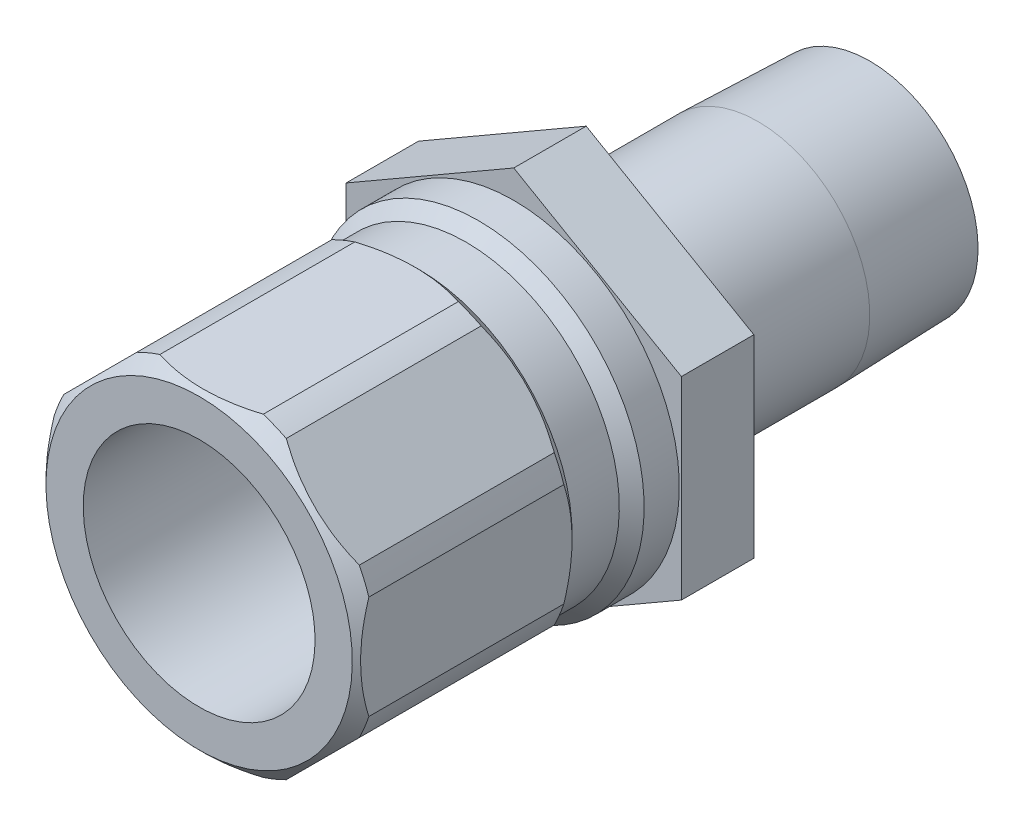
ISO-10303-21;
HEADER;
FILE_DESCRIPTION(('STEP AP214'),'2;1');
FILE_NAME('part.step','',(''),(''),'','','');
FILE_SCHEMA(('AUTOMOTIVE_DESIGN { 1 0 10303 214 1 1 1 1 }'));
ENDSEC;
DATA;
#1=APPLICATION_CONTEXT('core data for automotive mechanical design processes');
#2=APPLICATION_PROTOCOL_DEFINITION('international standard','automotive_design',2000,#1);
#3=PRODUCT_CONTEXT('',#1,'mechanical');
#4=PRODUCT('Part','Part','',(#3));
#5=PRODUCT_RELATED_PRODUCT_CATEGORY('part','',(#4));
#6=PRODUCT_DEFINITION_FORMATION('','',#4);
#7=PRODUCT_DEFINITION_CONTEXT('part definition',#1,'design');
#8=PRODUCT_DEFINITION('design','',#6,#7);
#9=PRODUCT_DEFINITION_SHAPE('','',#8);
#10=(LENGTH_UNIT() NAMED_UNIT(*) SI_UNIT(.MILLI.,.METRE.));
#11=(NAMED_UNIT(*) PLANE_ANGLE_UNIT() SI_UNIT($,.RADIAN.));
#12=(NAMED_UNIT(*) SI_UNIT($,.STERADIAN.) SOLID_ANGLE_UNIT());
#13=UNCERTAINTY_MEASURE_WITH_UNIT(LENGTH_MEASURE(1.E-05),#10,'distance_accuracy_value','');
#14=(GEOMETRIC_REPRESENTATION_CONTEXT(3) GLOBAL_UNCERTAINTY_ASSIGNED_CONTEXT((#13)) GLOBAL_UNIT_ASSIGNED_CONTEXT((#10,
#11,#12)) REPRESENTATION_CONTEXT('',''));
#15=CARTESIAN_POINT('',(0.,0.,0.));
#16=DIRECTION('',(0.,0.,1.));
#17=DIRECTION('',(1.,0.,0.));
#18=AXIS2_PLACEMENT_3D('',#15,#16,#17);
#19=CARTESIAN_POINT('',(0.,0.,0.));
#20=DIRECTION('',(0.,0.,-1.));
#21=DIRECTION('',(0.,1.,0.));
#22=AXIS2_PLACEMENT_3D('',#19,#20,#21);
#23=CYLINDRICAL_SURFACE('',#22,10.16);
#24=DIRECTION('',(0.,0.,-1.));
#25=VECTOR('',#24,1.);
#26=CARTESIAN_POINT('',(9.06826191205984,-4.58172739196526,0.));
#27=LINE('',#26,#25);
#28=CARTESIAN_POINT('',(9.06826191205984,-4.58172739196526,6.5786));
#29=VERTEX_POINT('',#28);
#30=CARTESIAN_POINT('',(9.06826191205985,-4.58172739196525,18.542));
#31=VERTEX_POINT('',#30);
#32=EDGE_CURVE('E400',#29,#31,#27,.F.);
#33=ORIENTED_EDGE('',*,*,#32,.F.);
#34=CARTESIAN_POINT('',(0.,0.,6.5786));
#35=DIRECTION('',(0.,0.,-1.));
#36=DIRECTION('',(0.,1.,0.));
#37=AXIS2_PLACEMENT_3D('',#34,#35,#36);
#38=CIRCLE('',#37,10.16);
#39=CARTESIAN_POINT('',(9.652,-3.17245898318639,6.5786));
#40=VERTEX_POINT('',#39);
#41=EDGE_CURVE('E402',#40,#29,#38,.T.);
#42=ORIENTED_EDGE('',*,*,#41,.F.);
#43=DIRECTION('',(0.,0.,-1.));
#44=VECTOR('',#43,1.);
#45=CARTESIAN_POINT('',(9.652,-3.17245898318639,0.));
#46=LINE('',#45,#44);
#47=CARTESIAN_POINT('',(9.652,-3.1724589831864,18.542));
#48=VERTEX_POINT('',#47);
#49=EDGE_CURVE('E380',#48,#40,#46,.T.);
#50=ORIENTED_EDGE('',*,*,#49,.F.);
#51=CARTESIAN_POINT('',(0.,0.,18.542));
#52=DIRECTION('',(0.,0.,-1.));
#53=DIRECTION('',(0.,1.,0.));
#54=AXIS2_PLACEMENT_3D('',#51,#52,#53);
#55=CIRCLE('',#54,10.16);
#56=EDGE_CURVE('E218',#48,#31,#55,.T.);
#57=ORIENTED_EDGE('',*,*,#56,.T.);
#58=EDGE_LOOP('',(#33,#42,#50,#57));
#59=FACE_BOUND('',#58,.T.);
#60=ADVANCED_FACE('F35',(#59),#23,.T.);
#61=DIRECTION('',(0.,0.,-1.));
#62=VECTOR('',#61,1.);
#63=CARTESIAN_POINT('',(9.652,3.1724589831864,0.));
#64=LINE('',#63,#62);
#65=CARTESIAN_POINT('',(9.652,3.1724589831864,6.5786));
#66=VERTEX_POINT('',#65);
#67=CARTESIAN_POINT('',(9.652,3.1724589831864,18.542));
#68=VERTEX_POINT('',#67);
#69=EDGE_CURVE('E321',#66,#68,#64,.F.);
#70=ORIENTED_EDGE('',*,*,#69,.F.);
#71=CARTESIAN_POINT('',(9.06826191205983,4.58172739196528,6.5786));
#72=VERTEX_POINT('',#71);
#73=EDGE_CURVE('E234',#72,#66,#38,.T.);
#74=ORIENTED_EDGE('',*,*,#73,.F.);
#75=DIRECTION('',(0.,0.,-1.));
#76=VECTOR('',#75,1.);
#77=CARTESIAN_POINT('',(9.06826191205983,4.58172739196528,0.));
#78=LINE('',#77,#76);
#79=CARTESIAN_POINT('',(9.06826191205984,4.58172739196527,18.542));
#80=VERTEX_POINT('',#79);
#81=EDGE_CURVE('E396',#80,#72,#78,.T.);
#82=ORIENTED_EDGE('',*,*,#81,.F.);
#83=EDGE_CURVE('E226',#80,#68,#55,.T.);
#84=ORIENTED_EDGE('',*,*,#83,.T.);
#85=EDGE_LOOP('',(#70,#74,#82,#84));
#86=FACE_BOUND('',#85,.T.);
#87=ADVANCED_FACE('F395',(#86),#23,.T.);
#88=DIRECTION('',(0.,0.,-1.));
#89=VECTOR('',#88,1.);
#90=CARTESIAN_POINT('',(4.58172739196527,9.06826191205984,0.));
#91=LINE('',#90,#89);
#92=CARTESIAN_POINT('',(4.58172739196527,9.06826191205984,6.5786));
#93=VERTEX_POINT('',#92);
#94=CARTESIAN_POINT('',(4.58172739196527,9.06826191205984,18.542));
#95=VERTEX_POINT('',#94);
#96=EDGE_CURVE('E381',#93,#95,#91,.F.);
#97=ORIENTED_EDGE('',*,*,#96,.F.);
#98=CARTESIAN_POINT('',(3.17245898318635,9.65200000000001,6.5786));
#99=VERTEX_POINT('',#98);
#100=EDGE_CURVE('E230',#99,#93,#38,.T.);
#101=ORIENTED_EDGE('',*,*,#100,.F.);
#102=DIRECTION('',(0.,0.,-1.));
#103=VECTOR('',#102,1.);
#104=CARTESIAN_POINT('',(3.17245898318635,9.65200000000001,0.));
#105=LINE('',#104,#103);
#106=CARTESIAN_POINT('',(3.17245898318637,9.65200000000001,18.542));
#107=VERTEX_POINT('',#106);
#108=EDGE_CURVE('E427',#107,#99,#105,.T.);
#109=ORIENTED_EDGE('',*,*,#108,.F.);
#110=EDGE_CURVE('E221',#107,#95,#55,.T.);
#111=ORIENTED_EDGE('',*,*,#110,.T.);
#112=EDGE_LOOP('',(#97,#101,#109,#111));
#113=FACE_BOUND('',#112,.T.);
#114=ADVANCED_FACE('F529',(#113),#23,.T.);
#115=DIRECTION('',(0.,0.,-1.));
#116=VECTOR('',#115,1.);
#117=CARTESIAN_POINT('',(-3.17245898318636,9.65200000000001,0.));
#118=LINE('',#117,#116);
#119=CARTESIAN_POINT('',(-3.17245898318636,9.65200000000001,6.5786));
#120=VERTEX_POINT('',#119);
#121=CARTESIAN_POINT('',(-3.17245898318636,9.65200000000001,18.542));
#122=VERTEX_POINT('',#121);
#123=EDGE_CURVE('E55',#120,#122,#118,.F.);
#124=ORIENTED_EDGE('',*,*,#123,.F.);
#125=CARTESIAN_POINT('',(-4.5817273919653,9.06826191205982,6.5786));
#126=VERTEX_POINT('',#125);
#127=EDGE_CURVE('E225',#126,#120,#38,.T.);
#128=ORIENTED_EDGE('',*,*,#127,.F.);
#129=DIRECTION('',(0.,0.,-1.));
#130=VECTOR('',#129,1.);
#131=CARTESIAN_POINT('',(-4.5817273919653,9.06826191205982,0.));
#132=LINE('',#131,#130);
#133=CARTESIAN_POINT('',(-4.5817273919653,9.06826191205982,18.542));
#134=VERTEX_POINT('',#133);
#135=EDGE_CURVE('E425',#134,#126,#132,.T.);
#136=ORIENTED_EDGE('',*,*,#135,.F.);
#137=EDGE_CURVE('E227',#134,#122,#55,.T.);
#138=ORIENTED_EDGE('',*,*,#137,.T.);
#139=EDGE_LOOP('',(#124,#128,#136,#138));
#140=FACE_BOUND('',#139,.T.);
#141=ADVANCED_FACE('F423',(#140),#23,.T.);
#142=DIRECTION('',(0.,0.,-1.));
#143=VECTOR('',#142,1.);
#144=CARTESIAN_POINT('',(-9.06826191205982,4.58172739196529,0.));
#145=LINE('',#144,#143);
#146=CARTESIAN_POINT('',(-9.06826191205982,4.58172739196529,6.5786));
#147=VERTEX_POINT('',#146);
#148=CARTESIAN_POINT('',(-9.06826191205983,4.58172739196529,18.542));
#149=VERTEX_POINT('',#148);
#150=EDGE_CURVE('E63',#147,#149,#145,.F.);
#151=ORIENTED_EDGE('',*,*,#150,.F.);
#152=CARTESIAN_POINT('',(-9.652,3.17245898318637,6.5786));
#153=VERTEX_POINT('',#152);
#154=EDGE_CURVE('E410',#153,#147,#38,.T.);
#155=ORIENTED_EDGE('',*,*,#154,.F.);
#156=DIRECTION('',(0.,0.,-1.));
#157=VECTOR('',#156,1.);
#158=CARTESIAN_POINT('',(-9.652,3.17245898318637,0.));
#159=LINE('',#158,#157);
#160=CARTESIAN_POINT('',(-9.652,3.17245898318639,18.542));
#161=VERTEX_POINT('',#160);
#162=EDGE_CURVE('E432',#161,#153,#159,.T.);
#163=ORIENTED_EDGE('',*,*,#162,.F.);
#164=EDGE_CURVE('E220',#161,#149,#55,.T.);
#165=ORIENTED_EDGE('',*,*,#164,.T.);
#166=EDGE_LOOP('',(#151,#155,#163,#165));
#167=FACE_BOUND('',#166,.T.);
#168=ADVANCED_FACE('F515',(#167),#23,.T.);
#169=DIRECTION('',(0.,0.,-1.));
#170=VECTOR('',#169,1.);
#171=CARTESIAN_POINT('',(-9.652,-3.17245898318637,0.));
#172=LINE('',#171,#170);
#173=CARTESIAN_POINT('',(-9.652,-3.17245898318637,6.5786));
#174=VERTEX_POINT('',#173);
#175=CARTESIAN_POINT('',(-9.652,-3.17245898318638,18.542));
#176=VERTEX_POINT('',#175);
#177=EDGE_CURVE('E429',#174,#176,#172,.F.);
#178=ORIENTED_EDGE('',*,*,#177,.F.);
#179=CARTESIAN_POINT('',(-9.06826191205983,-4.58172739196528,6.5786));
#180=VERTEX_POINT('',#179);
#181=EDGE_CURVE('E407',#180,#174,#38,.T.);
#182=ORIENTED_EDGE('',*,*,#181,.F.);
#183=DIRECTION('',(0.,0.,-1.));
#184=VECTOR('',#183,1.);
#185=CARTESIAN_POINT('',(-9.06826191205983,-4.58172739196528,0.));
#186=LINE('',#185,#184);
#187=CARTESIAN_POINT('',(-9.06826191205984,-4.58172739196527,18.542));
#188=VERTEX_POINT('',#187);
#189=EDGE_CURVE('E437',#188,#180,#186,.T.);
#190=ORIENTED_EDGE('',*,*,#189,.F.);
#191=EDGE_CURVE('E216',#188,#176,#55,.T.);
#192=ORIENTED_EDGE('',*,*,#191,.T.);
#193=EDGE_LOOP('',(#178,#182,#190,#192));
#194=FACE_BOUND('',#193,.T.);
#195=ADVANCED_FACE('F518',(#194),#23,.T.);
#196=DIRECTION('',(0.,0.,-1.));
#197=VECTOR('',#196,1.);
#198=CARTESIAN_POINT('',(-4.58172739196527,-9.06826191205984,0.));
#199=LINE('',#198,#197);
#200=CARTESIAN_POINT('',(-4.58172739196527,-9.06826191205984,6.5786));
#201=VERTEX_POINT('',#200);
#202=CARTESIAN_POINT('',(-4.58172739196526,-9.06826191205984,18.542));
#203=VERTEX_POINT('',#202);
#204=EDGE_CURVE('E435',#201,#203,#199,.F.);
#205=ORIENTED_EDGE('',*,*,#204,.F.);
#206=CARTESIAN_POINT('',(-3.1724589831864,-9.65199999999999,6.5786));
#207=VERTEX_POINT('',#206);
#208=EDGE_CURVE('E208',#207,#201,#38,.T.);
#209=ORIENTED_EDGE('',*,*,#208,.F.);
#210=DIRECTION('',(0.,0.,-1.));
#211=VECTOR('',#210,1.);
#212=CARTESIAN_POINT('',(-3.1724589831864,-9.65199999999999,0.));
#213=LINE('',#212,#211);
#214=CARTESIAN_POINT('',(-3.17245898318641,-9.652,18.542));
#215=VERTEX_POINT('',#214);
#216=EDGE_CURVE('E190',#215,#207,#213,.T.);
#217=ORIENTED_EDGE('',*,*,#216,.F.);
#218=EDGE_CURVE('E206',#215,#203,#55,.T.);
#219=ORIENTED_EDGE('',*,*,#218,.T.);
#220=EDGE_LOOP('',(#205,#209,#217,#219));
#221=FACE_BOUND('',#220,.T.);
#222=ADVANCED_FACE('F205',(#221),#23,.T.);
#223=CARTESIAN_POINT('',(0.,0.,0.));
#224=DIRECTION('',(0.,0.,-1.));
#225=DIRECTION('',(0.,1.,0.));
#226=AXIS2_PLACEMENT_3D('',#223,#224,#225);
#227=CYLINDRICAL_SURFACE('',#226,6.85799999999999);
#228=CARTESIAN_POINT('',(0.,0.,-14.986));
#229=DIRECTION('',(0.,0.,-1.));
#230=DIRECTION('',(0.,1.,0.));
#231=AXIS2_PLACEMENT_3D('',#228,#229,#230);
#232=CIRCLE('',#231,6.85799999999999);
#233=CARTESIAN_POINT('',(0.,6.858,-14.986));
#234=VERTEX_POINT('',#233);
#235=EDGE_CURVE('E246',#234,#234,#232,.T.);
#236=ORIENTED_EDGE('',*,*,#235,.F.);
#237=EDGE_LOOP('',(#236));
#238=FACE_BOUND('',#237,.T.);
#239=CARTESIAN_POINT('',(0.,0.,-4.445));
#240=DIRECTION('',(0.,0.,1.));
#241=DIRECTION('',(1.,0.,0.));
#242=AXIS2_PLACEMENT_3D('',#239,#240,#241);
#243=CIRCLE('',#242,6.85799999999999);
#244=CARTESIAN_POINT('',(6.85799999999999,0.,-4.445));
#245=VERTEX_POINT('',#244);
#246=EDGE_CURVE('E486',#245,#245,#243,.F.);
#247=ORIENTED_EDGE('',*,*,#246,.T.);
#248=EDGE_LOOP('',(#247));
#249=FACE_BOUND('',#248,.T.);
#250=ADVANCED_FACE('F524',(#238,#249),#227,.T.);
#251=CARTESIAN_POINT('',(0.,6.6436887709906,-21.844));
#252=DIRECTION('',(0.,0.,-1.));
#253=DIRECTION('',(0.,1.,0.));
#254=AXIS2_PLACEMENT_3D('',#251,#252,#253);
#255=PLANE('',#254);
#256=CARTESIAN_POINT('',(0.,0.,-21.844));
#257=DIRECTION('',(0.,0.,-1.));
#258=DIRECTION('',(0.,1.,0.));
#259=AXIS2_PLACEMENT_3D('',#256,#257,#258);
#260=CIRCLE('',#259,6.6436887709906);
#261=CARTESIAN_POINT('',(0.,6.6436887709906,-21.844));
#262=VERTEX_POINT('',#261);
#263=EDGE_CURVE('E199',#262,#262,#260,.T.);
#264=ORIENTED_EDGE('',*,*,#263,.T.);
#265=EDGE_LOOP('',(#264));
#266=FACE_BOUND('',#265,.T.);
#267=CARTESIAN_POINT('',(0.,0.,-21.844));
#268=DIRECTION('',(0.,0.,-1.));
#269=DIRECTION('',(0.,1.,0.));
#270=AXIS2_PLACEMENT_3D('',#267,#268,#269);
#271=CIRCLE('',#270,4.76249999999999);
#272=CARTESIAN_POINT('',(0.,4.76249999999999,-21.844));
#273=VERTEX_POINT('',#272);
#274=EDGE_CURVE('E498',#273,#273,#271,.T.);
#275=ORIENTED_EDGE('',*,*,#274,.F.);
#276=EDGE_LOOP('',(#275));
#277=FACE_BOUND('',#276,.T.);
#278=ADVANCED_FACE('F37',(#266,#277),#255,.T.);
#279=CARTESIAN_POINT('',(0.,0.,-21.844));
#280=DIRECTION('',(0.,0.,1.));
#281=DIRECTION('',(0.,-1.,0.));
#282=AXIS2_PLACEMENT_3D('',#279,#280,#281);
#283=CONICAL_SURFACE('',#282,6.6436887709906,0.0312396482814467);
#284=ORIENTED_EDGE('',*,*,#235,.T.);
#285=EDGE_LOOP('',(#284));
#286=FACE_BOUND('',#285,.T.);
#287=ORIENTED_EDGE('',*,*,#263,.F.);
#288=EDGE_LOOP('',(#287));
#289=FACE_BOUND('',#288,.T.);
#290=ADVANCED_FACE('F789',(#286,#289),#283,.T.);
#291=CARTESIAN_POINT('',(0.,0.,0.));
#292=DIRECTION('',(0.,0.,-1.));
#293=DIRECTION('',(0.,1.,0.));
#294=AXIS2_PLACEMENT_3D('',#291,#292,#293);
#295=CYLINDRICAL_SURFACE('',#294,10.16);
#296=CARTESIAN_POINT('',(0.,0.,2.159));
#297=DIRECTION('',(0.,0.,-1.));
#298=DIRECTION('',(0.,1.,0.));
#299=AXIS2_PLACEMENT_3D('',#296,#297,#298);
#300=CIRCLE('',#299,10.16);
#301=CARTESIAN_POINT('',(0.,10.16,2.159));
#302=VERTEX_POINT('',#301);
#303=EDGE_CURVE('E240',#302,#302,#300,.T.);
#304=ORIENTED_EDGE('',*,*,#303,.T.);
#305=EDGE_LOOP('',(#304));
#306=FACE_BOUND('',#305,.T.);
#307=CARTESIAN_POINT('',(0.,0.,0.));
#308=DIRECTION('',(0.,0.,-1.));
#309=DIRECTION('',(0.,1.,0.));
#310=AXIS2_PLACEMENT_3D('',#307,#308,#309);
#311=CIRCLE('',#310,10.16);
#312=CARTESIAN_POINT('',(0.,10.16,0.));
#313=VERTEX_POINT('',#312);
#314=EDGE_CURVE('E243',#313,#313,#311,.T.);
#315=ORIENTED_EDGE('',*,*,#314,.F.);
#316=EDGE_LOOP('',(#315));
#317=FACE_BOUND('',#316,.T.);
#318=ADVANCED_FACE('F781',(#306,#317),#295,.T.);
#319=CARTESIAN_POINT('',(0.,0.,2.159));
#320=DIRECTION('',(0.,0.,-1.));
#321=DIRECTION('',(0.,1.,0.));
#322=AXIS2_PLACEMENT_3D('',#319,#320,#321);
#323=CONICAL_SURFACE('',#322,10.16,0.785398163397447);
#324=CARTESIAN_POINT('',(0.,0.,2.921));
#325=DIRECTION('',(0.,0.,-1.));
#326=DIRECTION('',(0.,1.,0.));
#327=AXIS2_PLACEMENT_3D('',#324,#325,#326);
#328=CIRCLE('',#327,9.398);
#329=CARTESIAN_POINT('',(0.,9.398,2.921));
#330=VERTEX_POINT('',#329);
#331=EDGE_CURVE('E237',#330,#330,#328,.T.);
#332=ORIENTED_EDGE('',*,*,#331,.T.);
#333=EDGE_LOOP('',(#332));
#334=FACE_BOUND('',#333,.T.);
#335=ORIENTED_EDGE('',*,*,#303,.F.);
#336=EDGE_LOOP('',(#335));
#337=FACE_BOUND('',#336,.T.);
#338=ADVANCED_FACE('F773',(#334,#337),#323,.T.);
#339=CARTESIAN_POINT('',(0.,0.,0.));
#340=DIRECTION('',(0.,0.,-1.));
#341=DIRECTION('',(0.,1.,0.));
#342=AXIS2_PLACEMENT_3D('',#339,#340,#341);
#343=CYLINDRICAL_SURFACE('',#342,9.398);
#344=CARTESIAN_POINT('',(0.,0.,5.8166));
#345=DIRECTION('',(0.,0.,-1.));
#346=DIRECTION('',(0.,1.,0.));
#347=AXIS2_PLACEMENT_3D('',#344,#345,#346);
#348=CIRCLE('',#347,9.398);
#349=CARTESIAN_POINT('',(0.,9.398,5.8166));
#350=VERTEX_POINT('',#349);
#351=EDGE_CURVE('E233',#350,#350,#348,.T.);
#352=ORIENTED_EDGE('',*,*,#351,.T.);
#353=EDGE_LOOP('',(#352));
#354=FACE_BOUND('',#353,.T.);
#355=ORIENTED_EDGE('',*,*,#331,.F.);
#356=EDGE_LOOP('',(#355));
#357=FACE_BOUND('',#356,.T.);
#358=ADVANCED_FACE('F328',(#354,#357),#343,.T.);
#359=CARTESIAN_POINT('',(0.,0.,5.8166));
#360=DIRECTION('',(0.,0.,1.));
#361=DIRECTION('',(0.,-1.,0.));
#362=AXIS2_PLACEMENT_3D('',#359,#360,#361);
#363=CONICAL_SURFACE('',#362,9.398,0.785398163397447);
#364=CARTESIAN_POINT('',(4.58127452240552,-9.06871478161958,6.57880000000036));
#365=CARTESIAN_POINT('',(4.75252279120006,-8.89746651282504,6.50311112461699));
#366=CARTESIAN_POINT('',(4.92544531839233,-8.72454398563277,6.4345998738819));
#367=CARTESIAN_POINT('',(5.27427443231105,-8.37571487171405,6.31373109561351));
#368=CARTESIAN_POINT('',(5.45018402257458,-8.19980528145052,6.26139098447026));
#369=CARTESIAN_POINT('',(5.80016102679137,-7.84982827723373,6.17583376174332));
#370=CARTESIAN_POINT('',(5.97417704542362,-7.67581225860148,6.14220261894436));
#371=CARTESIAN_POINT('',(6.32342358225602,-7.32656572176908,6.09351088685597));
#372=CARTESIAN_POINT('',(6.4986534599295,-7.15133584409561,6.07844115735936));
#373=CARTESIAN_POINT('',(6.87393872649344,-6.77605057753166,6.06671407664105));
#374=CARTESIAN_POINT('',(7.07404283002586,-6.57594647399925,6.07292266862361));
#375=CARTESIAN_POINT('',(7.47322940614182,-6.17675989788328,6.10993961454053));
#376=CARTESIAN_POINT('',(7.67231100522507,-5.97767829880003,6.14076631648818));
#377=CARTESIAN_POINT('',(8.07332223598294,-5.57666706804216,6.22661050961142));
#378=CARTESIAN_POINT('',(8.27518426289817,-5.37480504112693,6.28225688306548));
#379=CARTESIAN_POINT('',(8.57507776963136,-5.07491153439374,6.38192162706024));
#380=CARTESIAN_POINT('',(8.67450584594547,-4.97548345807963,6.41781854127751));
#381=CARTESIAN_POINT('',(8.87236427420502,-4.77762502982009,6.49463428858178));
#382=CARTESIAN_POINT('',(8.97079484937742,-4.67919445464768,6.53555196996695));
#383=CARTESIAN_POINT('',(9.06871478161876,-4.58127452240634,6.5788));
#384=B_SPLINE_CURVE_WITH_KNOTS('',3,(#364,#365,#366,#367,#368,#369,#370,#371,#372,#373,#374,
#375,#376,#377,#378,#379,#380,#381,#382,#383),.UNSPECIFIED.,.F.,.F.,(4,2,2,2,2,2,2,2,2,4),(0.,
0.761268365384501,1.52335378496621,2.26782503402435,3.01192953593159,3.85997332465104,
4.7086497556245,5.58017277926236,6.01546212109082,6.45065179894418),.UNSPECIFIED.);
#385=CARTESIAN_POINT('',(4.58172739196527,-9.06826191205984,6.5786));
#386=VERTEX_POINT('',#385);
#387=EDGE_CURVE('E442',#386,#29,#384,.T.);
#388=ORIENTED_EDGE('',*,*,#387,.F.);
#389=CARTESIAN_POINT('',(3.1724589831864,-9.65199999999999,6.5786));
#390=VERTEX_POINT('',#389);
#391=EDGE_CURVE('E404',#386,#390,#38,.T.);
#392=ORIENTED_EDGE('',*,*,#391,.T.);
#393=CARTESIAN_POINT('',(-7.71050187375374,-9.652,8.77226112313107));
#394=CARTESIAN_POINT('',(-7.5247548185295,-9.652,8.65634461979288));
#395=CARTESIAN_POINT('',(-7.33786285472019,-9.652,8.54223754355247));
#396=CARTESIAN_POINT('',(-6.96152272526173,-9.652,8.31821876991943));
#397=CARTESIAN_POINT('',(-6.77207395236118,-9.652,8.20830809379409));
#398=CARTESIAN_POINT('',(-6.38961701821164,-9.652,7.99284972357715));
#399=CARTESIAN_POINT('',(-6.19659699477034,-9.652,7.88732298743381));
#400=CARTESIAN_POINT('',(-5.80760245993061,-9.652,7.68190773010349));
#401=CARTESIAN_POINT('',(-5.61162813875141,-9.652,7.58201884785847));
#402=CARTESIAN_POINT('',(-5.0102125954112,-9.652,7.28777670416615));
#403=CARTESIAN_POINT('',(-4.5996579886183,-9.652,7.10365831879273));
#404=CARTESIAN_POINT('',(-3.76461195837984,-9.652,6.77173137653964));
#405=CARTESIAN_POINT('',(-3.34014745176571,-9.652,6.62385690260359));
#406=CARTESIAN_POINT('',(-2.66836152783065,-9.652,6.43000243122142));
#407=CARTESIAN_POINT('',(-2.42567962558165,-9.652,6.36787612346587));
#408=CARTESIAN_POINT('',(-1.9366245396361,-9.652,6.260082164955));
#409=CARTESIAN_POINT('',(-1.69025117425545,-9.652,6.21441532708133));
#410=CARTESIAN_POINT('',(-1.1971622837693,-9.652,6.14153377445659));
#411=CARTESIAN_POINT('',(-0.950472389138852,-9.652,6.11414737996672));
#412=CARTESIAN_POINT('',(-0.455710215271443,-9.652,6.07820091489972));
#413=CARTESIAN_POINT('',(-0.207637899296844,-9.65199999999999,6.0696413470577));
#414=CARTESIAN_POINT('',(0.333683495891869,-9.65199999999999,6.07191804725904));
#415=CARTESIAN_POINT('',(0.626923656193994,-9.65199999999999,6.0865748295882));
#416=CARTESIAN_POINT('',(1.21094277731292,-9.65199999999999,6.14191623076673));
#417=CARTESIAN_POINT('',(1.501721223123,-9.65199999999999,6.1826061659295));
#418=CARTESIAN_POINT('',(2.08266136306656,-9.65199999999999,6.28854909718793));
#419=CARTESIAN_POINT('',(2.3727646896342,-9.65199999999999,6.3541179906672));
#420=CARTESIAN_POINT('',(2.94714147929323,-9.65199999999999,6.50671348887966));
#421=CARTESIAN_POINT('',(3.2314158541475,-9.65199999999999,6.5937367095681));
#422=CARTESIAN_POINT('',(3.82869981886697,-9.65199999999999,6.79798966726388));
#423=CARTESIAN_POINT('',(4.14087760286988,-9.65199999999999,6.91763184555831));
#424=CARTESIAN_POINT('',(4.75742701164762,-9.65199999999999,7.17572587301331));
#425=CARTESIAN_POINT('',(5.06179505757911,-9.65199999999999,7.31418616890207));
#426=CARTESIAN_POINT('',(5.66409479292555,-9.65199999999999,7.60669849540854));
#427=CARTESIAN_POINT('',(5.96200267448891,-9.65199999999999,7.76079916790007));
#428=CARTESIAN_POINT('',(6.55107386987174,-9.65199999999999,8.08121555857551));
#429=CARTESIAN_POINT('',(6.84223818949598,-9.65199999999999,8.24752943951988));
#430=CARTESIAN_POINT('',(7.40668231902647,-9.65199999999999,8.58292080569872));
#431=CARTESIAN_POINT('',(7.68020242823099,-9.65199999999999,8.75159598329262));
#432=CARTESIAN_POINT('',(8.22250898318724,-9.65199999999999,9.09641460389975));
#433=CARTESIAN_POINT('',(8.49129505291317,-9.65199999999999,9.27255863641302));
#434=CARTESIAN_POINT('',(9.02258177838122,-9.65199999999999,9.62956600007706));
#435=CARTESIAN_POINT('',(9.28511552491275,-9.65199999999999,9.8103802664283));
#436=CARTESIAN_POINT('',(9.80652727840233,-9.65199999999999,10.1770543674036));
#437=CARTESIAN_POINT('',(10.0654063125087,-9.65199999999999,10.3629127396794));
#438=CARTESIAN_POINT('',(10.3227473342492,-9.65199999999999,10.5508403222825));
#439=B_SPLINE_CURVE_WITH_KNOTS('',3,(#393,#394,#395,#396,#397,#398,#399,#400,#401,#402,#403,
#404,#405,#406,#407,#408,#409,#410,#411,#412,#413,#414,#415,#416,#417,#418,#419,#420,#421,#422,
#423,#424,#425,#426,#427,#428,#429,#430,#431,#432,#433,#434,#435,#436,#437,#438),.UNSPECIFIED.,
.F.,.F.,(4,2,2,2,2,2,2,2,2,2,2,2,2,2,2,2,2,2,2,2,2,2,4),(0.,0.656855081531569,1.31386901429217,
1.97372850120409,2.63354568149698,3.98211483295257,5.32821282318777,6.07925616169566,
6.83033658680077,7.57426013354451,8.31820354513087,9.19777414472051,10.0775244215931,
10.9688407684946,11.8600166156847,12.8622077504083,13.8648502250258,14.8707124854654,
15.8764237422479,16.8403261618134,17.8043048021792,18.7605668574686,19.7165545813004),.UNSPECIFIED.);
#440=EDGE_CURVE('E334',#207,#390,#439,.T.);
#441=ORIENTED_EDGE('',*,*,#440,.F.);
#442=ORIENTED_EDGE('',*,*,#208,.T.);
#443=CARTESIAN_POINT('',(-9.06871478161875,-4.58127452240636,6.5788));
#444=CARTESIAN_POINT('',(-8.89746651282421,-4.7525227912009,6.50311112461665));
#445=CARTESIAN_POINT('',(-8.72454398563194,-4.92544531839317,6.43459987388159));
#446=CARTESIAN_POINT('',(-8.37571487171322,-5.27427443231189,6.31373109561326));
#447=CARTESIAN_POINT('',(-8.1998052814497,-5.45018402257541,6.26139098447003));
#448=CARTESIAN_POINT('',(-7.84982827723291,-5.8001610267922,6.17583376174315));
#449=CARTESIAN_POINT('',(-7.67581225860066,-5.97417704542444,6.14220261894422));
#450=CARTESIAN_POINT('',(-7.32656572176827,-6.32342358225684,6.09351088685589));
#451=CARTESIAN_POINT('',(-7.1513358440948,-6.49865345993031,6.07844115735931));
#452=CARTESIAN_POINT('',(-6.77605057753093,-6.87393872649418,6.06671407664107));
#453=CARTESIAN_POINT('',(-6.57594647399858,-7.07404283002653,6.07292266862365));
#454=CARTESIAN_POINT('',(-6.17675989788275,-7.47322940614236,6.10993961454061));
#455=CARTESIAN_POINT('',(-5.97767829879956,-7.67231100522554,6.14076631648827));
#456=CARTESIAN_POINT('',(-5.57666706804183,-8.07332223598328,6.22661050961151));
#457=CARTESIAN_POINT('',(-5.37480504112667,-8.27518426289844,6.28225688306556));
#458=CARTESIAN_POINT('',(-5.07491153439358,-8.57507776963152,6.3819216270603));
#459=CARTESIAN_POINT('',(-4.97548345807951,-8.67450584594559,6.41781854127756));
#460=CARTESIAN_POINT('',(-4.77762502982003,-8.87236427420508,6.49463428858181));
#461=CARTESIAN_POINT('',(-4.67919445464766,-8.97079484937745,6.53555196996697));
#462=CARTESIAN_POINT('',(-4.58127452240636,-9.06871478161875,6.5788));
#463=B_SPLINE_CURVE_WITH_KNOTS('',3,(#443,#444,#445,#446,#447,#448,#449,#450,#451,#452,#453,
#454,#455,#456,#457,#458,#459,#460,#461,#462),.UNSPECIFIED.,.F.,.F.,(4,2,2,2,2,2,2,2,2,4),(0.,
0.761268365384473,1.52335378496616,2.26782503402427,3.01192953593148,3.85997332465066,
4.70864975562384,5.5801727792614,6.01546212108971,6.45065179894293),.UNSPECIFIED.);
#464=EDGE_CURVE('E344',#180,#201,#463,.T.);
#465=ORIENTED_EDGE('',*,*,#464,.F.);
#466=ORIENTED_EDGE('',*,*,#181,.T.);
#467=CARTESIAN_POINT('',(-9.652,-7.71050187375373,8.77226112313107));
#468=CARTESIAN_POINT('',(-9.652,-7.52475481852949,8.65634461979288));
#469=CARTESIAN_POINT('',(-9.652,-7.33786285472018,8.54223754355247));
#470=CARTESIAN_POINT('',(-9.652,-6.96152272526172,8.31821876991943));
#471=CARTESIAN_POINT('',(-9.652,-6.77207395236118,8.20830809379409));
#472=CARTESIAN_POINT('',(-9.652,-6.38961701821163,7.99284972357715));
#473=CARTESIAN_POINT('',(-9.652,-6.19659699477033,7.88732298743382));
#474=CARTESIAN_POINT('',(-9.652,-5.80760245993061,7.6819077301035));
#475=CARTESIAN_POINT('',(-9.652,-5.6116281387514,7.58201884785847));
#476=CARTESIAN_POINT('',(-9.652,-5.01021259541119,7.28777670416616));
#477=CARTESIAN_POINT('',(-9.652,-4.59965798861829,7.10365831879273));
#478=CARTESIAN_POINT('',(-9.652,-3.76461195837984,6.77173137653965));
#479=CARTESIAN_POINT('',(-9.652,-3.34014745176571,6.6238569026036));
#480=CARTESIAN_POINT('',(-9.652,-2.66836152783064,6.43000243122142));
#481=CARTESIAN_POINT('',(-9.652,-2.42567962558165,6.36787612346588));
#482=CARTESIAN_POINT('',(-9.652,-1.9366245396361,6.260082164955));
#483=CARTESIAN_POINT('',(-9.652,-1.69025117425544,6.21441532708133));
#484=CARTESIAN_POINT('',(-9.652,-1.1971622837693,6.1415337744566));
#485=CARTESIAN_POINT('',(-9.652,-0.950472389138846,6.11414737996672));
#486=CARTESIAN_POINT('',(-9.652,-0.455710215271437,6.07820091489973));
#487=CARTESIAN_POINT('',(-9.652,-0.207637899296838,6.06964134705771));
#488=CARTESIAN_POINT('',(-9.652,0.333683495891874,6.07191804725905));
#489=CARTESIAN_POINT('',(-9.652,0.626923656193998,6.08657482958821));
#490=CARTESIAN_POINT('',(-9.652,1.21094277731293,6.14191623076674));
#491=CARTESIAN_POINT('',(-9.652,1.501721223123,6.18260616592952));
#492=CARTESIAN_POINT('',(-9.652,2.08266136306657,6.28854909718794));
#493=CARTESIAN_POINT('',(-9.652,2.37276468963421,6.35411799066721));
#494=CARTESIAN_POINT('',(-9.652,2.94714147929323,6.50671348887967));
#495=CARTESIAN_POINT('',(-9.652,3.2314158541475,6.59373670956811));
#496=CARTESIAN_POINT('',(-9.652,3.82869981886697,6.79798966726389));
#497=CARTESIAN_POINT('',(-9.652,4.14087760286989,6.91763184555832));
#498=CARTESIAN_POINT('',(-9.652,4.75742701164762,7.17572587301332));
#499=CARTESIAN_POINT('',(-9.652,5.06179505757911,7.31418616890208));
#500=CARTESIAN_POINT('',(-9.652,5.66409479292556,7.60669849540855));
#501=CARTESIAN_POINT('',(-9.652,5.96200267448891,7.76079916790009));
#502=CARTESIAN_POINT('',(-9.652,6.55107386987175,8.08121555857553));
#503=CARTESIAN_POINT('',(-9.652,6.84223818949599,8.2475294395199));
#504=CARTESIAN_POINT('',(-9.652,7.40668231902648,8.58292080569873));
#505=CARTESIAN_POINT('',(-9.652,7.68020242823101,8.75159598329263));
#506=CARTESIAN_POINT('',(-9.652,8.22250898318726,9.09641460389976));
#507=CARTESIAN_POINT('',(-9.652,8.49129505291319,9.27255863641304));
#508=CARTESIAN_POINT('',(-9.652,9.02258177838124,9.62956600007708));
#509=CARTESIAN_POINT('',(-9.652,9.28511552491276,9.81038026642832));
#510=CARTESIAN_POINT('',(-9.652,9.80652727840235,10.1770543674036));
#511=CARTESIAN_POINT('',(-9.652,10.0654063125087,10.3629127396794));
#512=CARTESIAN_POINT('',(-9.652,10.3227473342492,10.5508403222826));
#513=B_SPLINE_CURVE_WITH_KNOTS('',3,(#467,#468,#469,#470,#471,#472,#473,#474,#475,#476,#477,
#478,#479,#480,#481,#482,#483,#484,#485,#486,#487,#488,#489,#490,#491,#492,#493,#494,#495,#496,
#497,#498,#499,#500,#501,#502,#503,#504,#505,#506,#507,#508,#509,#510,#511,#512),.UNSPECIFIED.,
.F.,.F.,(4,2,2,2,2,2,2,2,2,2,2,2,2,2,2,2,2,2,2,2,2,2,4),(0.,0.656855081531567,1.31386901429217,
1.97372850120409,2.63354568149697,3.98211483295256,5.32821282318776,6.07925616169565,
6.83033658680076,7.5742601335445,8.31820354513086,9.1977741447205,10.0775244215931,
10.9688407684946,11.8600166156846,12.8622077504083,13.8648502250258,14.8707124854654,
15.8764237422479,16.8403261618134,17.8043048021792,18.7605668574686,19.7165545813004),.UNSPECIFIED.);
#514=EDGE_CURVE('E352',#153,#174,#513,.F.);
#515=ORIENTED_EDGE('',*,*,#514,.F.);
#516=ORIENTED_EDGE('',*,*,#154,.T.);
#517=CARTESIAN_POINT('',(-4.58127452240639,9.06871478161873,6.5788));
#518=CARTESIAN_POINT('',(-4.75252279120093,8.89746651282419,6.50311112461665));
#519=CARTESIAN_POINT('',(-4.9254453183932,8.72454398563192,6.43459987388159));
#520=CARTESIAN_POINT('',(-5.27427443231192,8.3757148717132,6.31373109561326));
#521=CARTESIAN_POINT('',(-5.45018402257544,8.19980528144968,6.26139098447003));
#522=CARTESIAN_POINT('',(-5.80016102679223,7.84982827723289,6.17583376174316));
#523=CARTESIAN_POINT('',(-5.97417704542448,7.67581225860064,6.14220261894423));
#524=CARTESIAN_POINT('',(-6.32342358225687,7.32656572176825,6.0935108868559));
#525=CARTESIAN_POINT('',(-6.49865345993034,7.15133584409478,6.07844115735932));
#526=CARTESIAN_POINT('',(-6.87393872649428,6.77605057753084,6.06671407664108));
#527=CARTESIAN_POINT('',(-7.0740428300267,6.57594647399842,6.07292266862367));
#528=CARTESIAN_POINT('',(-7.47322940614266,6.17675989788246,6.10993961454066));
#529=CARTESIAN_POINT('',(-7.6723110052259,5.97767829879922,6.14076631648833));
#530=CARTESIAN_POINT('',(-8.07332223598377,5.57666706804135,6.22661050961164));
#531=CARTESIAN_POINT('',(-8.275184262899,5.37480504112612,6.28225688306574));
#532=CARTESIAN_POINT('',(-8.57507776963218,5.07491153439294,6.38192162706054));
#533=CARTESIAN_POINT('',(-8.67450584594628,4.97548345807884,6.41781854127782));
#534=CARTESIAN_POINT('',(-8.87236427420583,4.77762502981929,6.49463428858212));
#535=CARTESIAN_POINT('',(-8.97079484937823,4.67919445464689,6.53555196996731));
#536=CARTESIAN_POINT('',(-9.06871478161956,4.58127452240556,6.57880000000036));
#537=B_SPLINE_CURVE_WITH_KNOTS('',3,(#517,#518,#519,#520,#521,#522,#523,#524,#525,#526,#527,
#528,#529,#530,#531,#532,#533,#534,#535,#536),.UNSPECIFIED.,.F.,.F.,(4,2,2,2,2,2,2,2,2,4),(0.,
0.761268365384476,1.52335378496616,2.26782503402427,3.01192953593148,3.85997332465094,
4.7086497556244,5.58017277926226,6.01546212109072,6.45065179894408),.UNSPECIFIED.);
#538=EDGE_CURVE('E360',#126,#147,#537,.T.);
#539=ORIENTED_EDGE('',*,*,#538,.F.);
#540=ORIENTED_EDGE('',*,*,#127,.T.);
#541=CARTESIAN_POINT('',(-7.71050187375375,9.652,8.77226112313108));
#542=CARTESIAN_POINT('',(-7.52475481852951,9.652,8.65634461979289));
#543=CARTESIAN_POINT('',(-7.33786285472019,9.652,8.54223754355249));
#544=CARTESIAN_POINT('',(-6.96152272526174,9.652,8.31821876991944));
#545=CARTESIAN_POINT('',(-6.77207395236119,9.652,8.2083080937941));
#546=CARTESIAN_POINT('',(-6.38961701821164,9.652,7.99284972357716));
#547=CARTESIAN_POINT('',(-6.19659699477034,9.652,7.88732298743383));
#548=CARTESIAN_POINT('',(-5.80760245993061,9.652,7.68190773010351));
#549=CARTESIAN_POINT('',(-5.61162813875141,9.65200000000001,7.58201884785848));
#550=CARTESIAN_POINT('',(-5.0102125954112,9.65200000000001,7.28777670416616));
#551=CARTESIAN_POINT('',(-4.5996579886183,9.65200000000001,7.10365831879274));
#552=CARTESIAN_POINT('',(-3.76461195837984,9.65200000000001,6.77173137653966));
#553=CARTESIAN_POINT('',(-3.34014745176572,9.65200000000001,6.6238569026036));
#554=CARTESIAN_POINT('',(-2.66836152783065,9.65200000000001,6.43000243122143));
#555=CARTESIAN_POINT('',(-2.42567962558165,9.65200000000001,6.36787612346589));
#556=CARTESIAN_POINT('',(-1.9366245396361,9.65200000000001,6.26008216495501));
#557=CARTESIAN_POINT('',(-1.69025117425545,9.65200000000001,6.21441532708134));
#558=CARTESIAN_POINT('',(-1.19716228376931,9.65200000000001,6.1415337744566));
#559=CARTESIAN_POINT('',(-0.950472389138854,9.65200000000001,6.11414737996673));
#560=CARTESIAN_POINT('',(-0.455710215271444,9.65200000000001,6.07820091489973));
#561=CARTESIAN_POINT('',(-0.207637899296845,9.65200000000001,6.06964134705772));
#562=CARTESIAN_POINT('',(0.333683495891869,9.65200000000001,6.07191804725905));
#563=CARTESIAN_POINT('',(0.626923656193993,9.65200000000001,6.08657482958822));
#564=CARTESIAN_POINT('',(1.21094277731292,9.65200000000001,6.14191623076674));
#565=CARTESIAN_POINT('',(1.501721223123,9.65200000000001,6.18260616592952));
#566=CARTESIAN_POINT('',(2.08266136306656,9.65200000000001,6.28854909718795));
#567=CARTESIAN_POINT('',(2.3727646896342,9.65200000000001,6.35411799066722));
#568=CARTESIAN_POINT('',(2.94714147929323,9.65200000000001,6.50671348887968));
#569=CARTESIAN_POINT('',(3.23141585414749,9.65200000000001,6.59373670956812));
#570=CARTESIAN_POINT('',(3.82869981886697,9.65200000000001,6.79798966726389));
#571=CARTESIAN_POINT('',(4.14087760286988,9.65200000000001,6.91763184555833));
#572=CARTESIAN_POINT('',(4.75742701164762,9.65200000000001,7.17572587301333));
#573=CARTESIAN_POINT('',(5.06179505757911,9.65200000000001,7.31418616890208));
#574=CARTESIAN_POINT('',(5.66409479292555,9.65200000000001,7.60669849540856));
#575=CARTESIAN_POINT('',(5.9620026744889,9.65200000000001,7.76079916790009));
#576=CARTESIAN_POINT('',(6.55107386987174,9.65200000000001,8.08121555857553));
#577=CARTESIAN_POINT('',(6.84223818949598,9.65200000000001,8.2475294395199));
#578=CARTESIAN_POINT('',(7.40668231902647,9.65200000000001,8.58292080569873));
#579=CARTESIAN_POINT('',(7.680202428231,9.65200000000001,8.75159598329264));
#580=CARTESIAN_POINT('',(8.22250898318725,9.65200000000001,9.09641460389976));
#581=CARTESIAN_POINT('',(8.49129505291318,9.65200000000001,9.27255863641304));
#582=CARTESIAN_POINT('',(9.02258177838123,9.65200000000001,9.62956600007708));
#583=CARTESIAN_POINT('',(9.28511552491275,9.65200000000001,9.81038026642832));
#584=CARTESIAN_POINT('',(9.80652727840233,9.65200000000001,10.1770543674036));
#585=CARTESIAN_POINT('',(10.0654063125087,9.65200000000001,10.3629127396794));
#586=CARTESIAN_POINT('',(10.3227473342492,9.65200000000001,10.5508403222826));
#587=B_SPLINE_CURVE_WITH_KNOTS('',3,(#541,#542,#543,#544,#545,#546,#547,#548,#549,#550,#551,
#552,#553,#554,#555,#556,#557,#558,#559,#560,#561,#562,#563,#564,#565,#566,#567,#568,#569,#570,
#571,#572,#573,#574,#575,#576,#577,#578,#579,#580,#581,#582,#583,#584,#585,#586),.UNSPECIFIED.,
.F.,.F.,(4,2,2,2,2,2,2,2,2,2,2,2,2,2,2,2,2,2,2,2,2,2,4),(0.,0.65685508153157,1.31386901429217,
1.9737285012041,2.63354568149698,3.98211483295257,5.32821282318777,6.07925616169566,
6.83033658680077,7.57426013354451,8.31820354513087,9.19777414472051,10.0775244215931,
10.9688407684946,11.8600166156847,12.8622077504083,13.8648502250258,14.8707124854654,
15.8764237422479,16.8403261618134,17.8043048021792,18.7605668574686,19.7165545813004),.UNSPECIFIED.);
#588=EDGE_CURVE('E368',#99,#120,#587,.F.);
#589=ORIENTED_EDGE('',*,*,#588,.F.);
#590=ORIENTED_EDGE('',*,*,#100,.T.);
#591=CARTESIAN_POINT('',(9.06871478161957,4.58127452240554,6.57880000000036));
#592=CARTESIAN_POINT('',(8.89746651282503,4.75252279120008,6.50311112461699));
#593=CARTESIAN_POINT('',(8.72454398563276,4.92544531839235,6.4345998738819));
#594=CARTESIAN_POINT('',(8.37571487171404,5.27427443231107,6.31373109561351));
#595=CARTESIAN_POINT('',(8.19980528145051,5.45018402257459,6.26139098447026));
#596=CARTESIAN_POINT('',(7.84982827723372,5.80016102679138,6.17583376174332));
#597=CARTESIAN_POINT('',(7.67581225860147,5.97417704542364,6.14220261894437));
#598=CARTESIAN_POINT('',(7.32656572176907,6.32342358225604,6.09351088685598));
#599=CARTESIAN_POINT('',(7.1513358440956,6.49865345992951,6.07844115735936));
#600=CARTESIAN_POINT('',(6.77605057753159,6.87393872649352,6.06671407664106));
#601=CARTESIAN_POINT('',(6.5759464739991,7.07404283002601,6.07292266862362));
#602=CARTESIAN_POINT('',(6.176759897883,7.4732294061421,6.10993961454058));
#603=CARTESIAN_POINT('',(5.97767829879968,7.67231100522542,6.14076631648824));
#604=CARTESIAN_POINT('',(5.57666706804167,8.07332223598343,6.22661050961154));
#605=CARTESIAN_POINT('',(5.37480504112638,8.27518426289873,6.28225688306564));
#606=CARTESIAN_POINT('',(5.07491153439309,8.57507776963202,6.38192162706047));
#607=CARTESIAN_POINT('',(4.97548345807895,8.67450584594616,6.41781854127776));
#608=CARTESIAN_POINT('',(4.77762502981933,8.87236427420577,6.49463428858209));
#609=CARTESIAN_POINT('',(4.6791944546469,8.97079484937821,6.53555196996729));
#610=CARTESIAN_POINT('',(4.58127452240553,9.06871478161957,6.57880000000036));
#611=B_SPLINE_CURVE_WITH_KNOTS('',3,(#591,#592,#593,#594,#595,#596,#597,#598,#599,#600,#601,
#602,#603,#604,#605,#606,#607,#608,#609,#610),.UNSPECIFIED.,.F.,.F.,(4,2,2,2,2,2,2,2,2,4),(0.,
0.761268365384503,1.52335378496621,2.26782503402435,3.01192953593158,3.85997332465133,
4.70864975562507,5.58017277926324,6.01546212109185,6.45065179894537),.UNSPECIFIED.);
#612=EDGE_CURVE('E375',#72,#93,#611,.T.);
#613=ORIENTED_EDGE('',*,*,#612,.F.);
#614=ORIENTED_EDGE('',*,*,#73,.T.);
#615=CARTESIAN_POINT('',(9.652,-7.71050187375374,8.77226112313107));
#616=CARTESIAN_POINT('',(9.652,-7.52475481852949,8.65634461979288));
#617=CARTESIAN_POINT('',(9.652,-7.33786285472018,8.54223754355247));
#618=CARTESIAN_POINT('',(9.652,-6.96152272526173,8.31821876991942));
#619=CARTESIAN_POINT('',(9.652,-6.77207395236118,8.20830809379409));
#620=CARTESIAN_POINT('',(9.652,-6.38961701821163,7.99284972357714));
#621=CARTESIAN_POINT('',(9.652,-6.19659699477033,7.88732298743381));
#622=CARTESIAN_POINT('',(9.652,-5.80760245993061,7.68190773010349));
#623=CARTESIAN_POINT('',(9.652,-5.6116281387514,7.58201884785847));
#624=CARTESIAN_POINT('',(9.652,-5.01021259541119,7.28777670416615));
#625=CARTESIAN_POINT('',(9.652,-4.59965798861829,7.10365831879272));
#626=CARTESIAN_POINT('',(9.652,-3.76461195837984,6.77173137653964));
#627=CARTESIAN_POINT('',(9.652,-3.34014745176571,6.62385690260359));
#628=CARTESIAN_POINT('',(9.652,-2.66836152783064,6.43000243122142));
#629=CARTESIAN_POINT('',(9.652,-2.42567962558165,6.36787612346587));
#630=CARTESIAN_POINT('',(9.652,-1.9366245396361,6.260082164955));
#631=CARTESIAN_POINT('',(9.652,-1.69025117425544,6.21441532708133));
#632=CARTESIAN_POINT('',(9.652,-1.1971622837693,6.14153377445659));
#633=CARTESIAN_POINT('',(9.652,-0.950472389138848,6.11414737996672));
#634=CARTESIAN_POINT('',(9.652,-0.455710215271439,6.07820091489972));
#635=CARTESIAN_POINT('',(9.65199999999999,-0.20763789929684,6.0696413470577));
#636=CARTESIAN_POINT('',(9.65199999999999,0.333683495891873,6.07191804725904));
#637=CARTESIAN_POINT('',(9.65199999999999,0.626923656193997,6.08657482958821));
#638=CARTESIAN_POINT('',(9.65199999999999,1.21094277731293,6.14191623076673));
#639=CARTESIAN_POINT('',(9.65199999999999,1.501721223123,6.18260616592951));
#640=CARTESIAN_POINT('',(9.65199999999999,2.08266136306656,6.28854909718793));
#641=CARTESIAN_POINT('',(9.65199999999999,2.3727646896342,6.3541179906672));
#642=CARTESIAN_POINT('',(9.65199999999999,2.94714147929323,6.50671348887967));
#643=CARTESIAN_POINT('',(9.65199999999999,3.2314158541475,6.5937367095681));
#644=CARTESIAN_POINT('',(9.65199999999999,3.82869981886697,6.79798966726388));
#645=CARTESIAN_POINT('',(9.65199999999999,4.14087760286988,6.91763184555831));
#646=CARTESIAN_POINT('',(9.65199999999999,4.75742701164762,7.17572587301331));
#647=CARTESIAN_POINT('',(9.65199999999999,5.06179505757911,7.31418616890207));
#648=CARTESIAN_POINT('',(9.65199999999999,5.66409479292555,7.60669849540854));
#649=CARTESIAN_POINT('',(9.65199999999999,5.96200267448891,7.76079916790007));
#650=CARTESIAN_POINT('',(9.65199999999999,6.55107386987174,8.08121555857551));
#651=CARTESIAN_POINT('',(9.65199999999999,6.84223818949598,8.24752943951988));
#652=CARTESIAN_POINT('',(9.65199999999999,7.40668231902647,8.58292080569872));
#653=CARTESIAN_POINT('',(9.65199999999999,7.680202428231,8.75159598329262));
#654=CARTESIAN_POINT('',(9.65199999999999,8.22250898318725,9.09641460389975));
#655=CARTESIAN_POINT('',(9.65199999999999,8.49129505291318,9.27255863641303));
#656=CARTESIAN_POINT('',(9.65199999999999,9.02258177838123,9.62956600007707));
#657=CARTESIAN_POINT('',(9.65199999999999,9.28511552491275,9.81038026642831));
#658=CARTESIAN_POINT('',(9.65199999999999,9.80652727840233,10.1770543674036));
#659=CARTESIAN_POINT('',(9.65199999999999,10.0654063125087,10.3629127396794));
#660=CARTESIAN_POINT('',(9.65199999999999,10.3227473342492,10.5508403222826));
#661=B_SPLINE_CURVE_WITH_KNOTS('',3,(#615,#616,#617,#618,#619,#620,#621,#622,#623,#624,#625,
#626,#627,#628,#629,#630,#631,#632,#633,#634,#635,#636,#637,#638,#639,#640,#641,#642,#643,#644,
#645,#646,#647,#648,#649,#650,#651,#652,#653,#654,#655,#656,#657,#658,#659,#660),.UNSPECIFIED.,
.F.,.F.,(4,2,2,2,2,2,2,2,2,2,2,2,2,2,2,2,2,2,2,2,2,2,4),(0.,0.656855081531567,1.31386901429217,
1.97372850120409,2.63354568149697,3.98211483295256,5.32821282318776,6.07925616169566,
6.83033658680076,7.5742601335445,8.31820354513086,9.1977741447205,10.0775244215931,
10.9688407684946,11.8600166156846,12.8622077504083,13.8648502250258,14.8707124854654,
15.8764237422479,16.8403261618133,17.8043048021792,18.7605668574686,19.7165545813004),.UNSPECIFIED.);
#662=EDGE_CURVE('E314',#40,#66,#661,.T.);
#663=ORIENTED_EDGE('',*,*,#662,.F.);
#664=ORIENTED_EDGE('',*,*,#41,.T.);
#665=EDGE_LOOP('',(#388,#392,#441,#442,#465,#466,#515,#516,#539,#540,#589,#590,#613,#614,#663,#664));
#666=FACE_BOUND('',#665,.T.);
#667=ORIENTED_EDGE('',*,*,#351,.F.);
#668=EDGE_LOOP('',(#667));
#669=FACE_BOUND('',#668,.T.);
#670=ADVANCED_FACE('F324',(#666,#669),#363,.T.);
#671=DIRECTION('',(0.,0.,-1.));
#672=VECTOR('',#671,1.);
#673=CARTESIAN_POINT('',(4.58172739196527,-9.06826191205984,0.));
#674=LINE('',#673,#672);
#675=CARTESIAN_POINT('',(4.58172739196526,-9.06826191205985,18.542));
#676=VERTEX_POINT('',#675);
#677=EDGE_CURVE('E320',#676,#386,#674,.T.);
#678=ORIENTED_EDGE('',*,*,#677,.F.);
#679=CARTESIAN_POINT('',(3.17245898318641,-9.652,18.542));
#680=VERTEX_POINT('',#679);
#681=EDGE_CURVE('E215',#676,#680,#55,.T.);
#682=ORIENTED_EDGE('',*,*,#681,.T.);
#683=DIRECTION('',(0.,0.,-1.));
#684=VECTOR('',#683,1.);
#685=CARTESIAN_POINT('',(3.1724589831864,-9.65199999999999,0.));
#686=LINE('',#685,#684);
#687=EDGE_CURVE('E193',#390,#680,#686,.F.);
#688=ORIENTED_EDGE('',*,*,#687,.F.);
#689=ORIENTED_EDGE('',*,*,#391,.F.);
#690=EDGE_LOOP('',(#678,#682,#688,#689));
#691=FACE_BOUND('',#690,.T.);
#692=ADVANCED_FACE('F266',(#691),#23,.T.);
#693=CARTESIAN_POINT('',(0.,0.,18.542));
#694=DIRECTION('',(0.,0.,-1.));
#695=DIRECTION('',(0.,1.,0.));
#696=AXIS2_PLACEMENT_3D('',#693,#694,#695);
#697=CONICAL_SURFACE('',#696,10.16,0.785398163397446);
#698=CARTESIAN_POINT('',(9.06871478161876,-4.58127452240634,18.5418));
#699=CARTESIAN_POINT('',(8.89746651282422,-4.75252279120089,18.6174888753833));
#700=CARTESIAN_POINT('',(8.72454398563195,-4.92544531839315,18.6860001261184));
#701=CARTESIAN_POINT('',(8.37571487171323,-5.27427443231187,18.8068689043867));
#702=CARTESIAN_POINT('',(8.19980528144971,-5.45018402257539,18.85920901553));
#703=CARTESIAN_POINT('',(7.84982827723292,-5.80016102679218,18.9447662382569));
#704=CARTESIAN_POINT('',(7.67581225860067,-5.97417704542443,18.9783973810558));
#705=CARTESIAN_POINT('',(7.32656572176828,-6.32342358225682,19.0270891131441));
#706=CARTESIAN_POINT('',(7.15133584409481,-6.49865345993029,19.0421588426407));
#707=CARTESIAN_POINT('',(6.77605057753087,-6.87393872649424,19.0538859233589));
#708=CARTESIAN_POINT('',(6.57594647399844,-7.07404283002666,19.0476773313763));
#709=CARTESIAN_POINT('',(6.17675989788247,-7.47322940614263,19.0106603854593));
#710=CARTESIAN_POINT('',(5.97767829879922,-7.67231100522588,18.9798336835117));
#711=CARTESIAN_POINT('',(5.57666706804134,-8.07332223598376,18.8939894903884));
#712=CARTESIAN_POINT('',(5.37480504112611,-8.27518426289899,18.8383431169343));
#713=CARTESIAN_POINT('',(5.07491153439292,-8.57507776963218,18.7386783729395));
#714=CARTESIAN_POINT('',(4.97548345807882,-8.67450584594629,18.7027814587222));
#715=CARTESIAN_POINT('',(4.77762502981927,-8.87236427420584,18.6259657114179));
#716=CARTESIAN_POINT('',(4.67919445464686,-8.97079484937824,18.5850480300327));
#717=CARTESIAN_POINT('',(4.58127452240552,-9.06871478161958,18.5417999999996));
#718=B_SPLINE_CURVE_WITH_KNOTS('',3,(#698,#699,#700,#701,#702,#703,#704,#705,#706,#707,#708,
#709,#710,#711,#712,#713,#714,#715,#716,#717),.UNSPECIFIED.,.F.,.F.,(4,2,2,2,2,2,2,2,2,4),(0.,
0.761268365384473,1.52335378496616,2.26782503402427,3.01192953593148,3.85997332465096,
4.70864975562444,5.58017277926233,6.0154621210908,6.45065179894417),.UNSPECIFIED.);
#719=EDGE_CURVE('E13',#31,#676,#718,.T.);
#720=ORIENTED_EDGE('',*,*,#719,.F.);
#721=ORIENTED_EDGE('',*,*,#56,.F.);
#722=CARTESIAN_POINT('',(9.652,-7.71050187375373,16.3483388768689));
#723=CARTESIAN_POINT('',(9.652,-7.52475481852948,16.4642553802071));
#724=CARTESIAN_POINT('',(9.652,-7.33786285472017,16.5783624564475));
#725=CARTESIAN_POINT('',(9.652,-6.96152272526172,16.8023812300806));
#726=CARTESIAN_POINT('',(9.652,-6.77207395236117,16.9122919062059));
#727=CARTESIAN_POINT('',(9.652,-6.38961701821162,17.1277502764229));
#728=CARTESIAN_POINT('',(9.652,-6.19659699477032,17.2332770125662));
#729=CARTESIAN_POINT('',(9.652,-5.8076024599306,17.4386922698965));
#730=CARTESIAN_POINT('',(9.652,-5.6116281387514,17.5385811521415));
#731=CARTESIAN_POINT('',(9.652,-5.01021259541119,17.8328232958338));
#732=CARTESIAN_POINT('',(9.652,-4.59965798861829,18.0169416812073));
#733=CARTESIAN_POINT('',(9.652,-3.76461195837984,18.3488686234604));
#734=CARTESIAN_POINT('',(9.652,-3.34014745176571,18.4967430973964));
#735=CARTESIAN_POINT('',(9.652,-2.66836152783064,18.6905975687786));
#736=CARTESIAN_POINT('',(9.652,-2.42567962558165,18.7527238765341));
#737=CARTESIAN_POINT('',(9.652,-1.9366245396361,18.860517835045));
#738=CARTESIAN_POINT('',(9.652,-1.69025117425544,18.9061846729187));
#739=CARTESIAN_POINT('',(9.652,-1.1971622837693,18.9790662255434));
#740=CARTESIAN_POINT('',(9.652,-0.950472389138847,19.0064526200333));
#741=CARTESIAN_POINT('',(9.652,-0.455710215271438,19.0423990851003));
#742=CARTESIAN_POINT('',(9.65199999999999,-0.207637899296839,19.0509586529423));
#743=CARTESIAN_POINT('',(9.65199999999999,0.333683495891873,19.048681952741));
#744=CARTESIAN_POINT('',(9.65199999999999,0.626923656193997,19.0340251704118));
#745=CARTESIAN_POINT('',(9.65199999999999,1.21094277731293,18.9786837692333));
#746=CARTESIAN_POINT('',(9.65199999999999,1.501721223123,18.9379938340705));
#747=CARTESIAN_POINT('',(9.65199999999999,2.08266136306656,18.8320509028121));
#748=CARTESIAN_POINT('',(9.65199999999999,2.3727646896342,18.7664820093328));
#749=CARTESIAN_POINT('',(9.65199999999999,2.94714147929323,18.6138865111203));
#750=CARTESIAN_POINT('',(9.65199999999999,3.23141585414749,18.5268632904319));
#751=CARTESIAN_POINT('',(9.65199999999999,3.82869981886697,18.3226103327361));
#752=CARTESIAN_POINT('',(9.65199999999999,4.14087760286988,18.2029681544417));
#753=CARTESIAN_POINT('',(9.65199999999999,4.75742701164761,17.9448741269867));
#754=CARTESIAN_POINT('',(9.65199999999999,5.0617950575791,17.8064138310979));
#755=CARTESIAN_POINT('',(9.65199999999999,5.66409479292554,17.5139015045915));
#756=CARTESIAN_POINT('',(9.65199999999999,5.9620026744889,17.3598008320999));
#757=CARTESIAN_POINT('',(9.65199999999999,6.55107386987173,17.0393844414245));
#758=CARTESIAN_POINT('',(9.65199999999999,6.84223818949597,16.8730705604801));
#759=CARTESIAN_POINT('',(9.65199999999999,7.40668231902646,16.5376791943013));
#760=CARTESIAN_POINT('',(9.65199999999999,7.68020242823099,16.3690040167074));
#761=CARTESIAN_POINT('',(9.65199999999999,8.22250898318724,16.0241853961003));
#762=CARTESIAN_POINT('',(9.65199999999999,8.49129505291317,15.848041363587));
#763=CARTESIAN_POINT('',(9.65199999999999,9.02258177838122,15.4910339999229));
#764=CARTESIAN_POINT('',(9.65199999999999,9.28511552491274,15.3102197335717));
#765=CARTESIAN_POINT('',(9.65199999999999,9.80652727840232,14.9435456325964));
#766=CARTESIAN_POINT('',(9.65199999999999,10.0654063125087,14.7576872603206));
#767=CARTESIAN_POINT('',(9.65199999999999,10.3227473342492,14.5697596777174));
#768=B_SPLINE_CURVE_WITH_KNOTS('',3,(#722,#723,#724,#725,#726,#727,#728,#729,#730,#731,#732,
#733,#734,#735,#736,#737,#738,#739,#740,#741,#742,#743,#744,#745,#746,#747,#748,#749,#750,#751,
#752,#753,#754,#755,#756,#757,#758,#759,#760,#761,#762,#763,#764,#765,#766,#767),.UNSPECIFIED.,
.F.,.F.,(4,2,2,2,2,2,2,2,2,2,2,2,2,2,2,2,2,2,2,2,2,2,4),(0.,0.656855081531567,1.31386901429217,
1.97372850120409,2.63354568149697,3.98211483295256,5.32821282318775,6.07925616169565,
6.83033658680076,7.5742601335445,8.31820354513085,9.19777414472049,10.0775244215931,
10.9688407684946,11.8600166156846,12.8622077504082,13.8648502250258,14.8707124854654,
15.8764237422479,16.8403261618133,17.8043048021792,18.7605668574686,19.7165545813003),.UNSPECIFIED.);
#769=EDGE_CURVE('E48',#68,#48,#768,.F.);
#770=ORIENTED_EDGE('',*,*,#769,.F.);
#771=ORIENTED_EDGE('',*,*,#83,.F.);
#772=CARTESIAN_POINT('',(4.58127452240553,9.06871478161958,18.5417999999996));
#773=CARTESIAN_POINT('',(4.75252279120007,8.89746651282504,18.617488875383));
#774=CARTESIAN_POINT('',(4.92544531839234,8.72454398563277,18.6860001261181));
#775=CARTESIAN_POINT('',(5.27427443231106,8.37571487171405,18.8068689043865));
#776=CARTESIAN_POINT('',(5.45018402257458,8.19980528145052,18.8592090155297));
#777=CARTESIAN_POINT('',(5.80016102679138,7.84982827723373,18.9447662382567));
#778=CARTESIAN_POINT('',(5.97417704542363,7.67581225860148,18.9783973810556));
#779=CARTESIAN_POINT('',(6.32342358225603,7.32656572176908,19.027089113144));
#780=CARTESIAN_POINT('',(6.4986534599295,7.1513358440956,19.0421588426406));
#781=CARTESIAN_POINT('',(6.87393872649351,6.77605057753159,19.0538859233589));
#782=CARTESIAN_POINT('',(7.074042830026,6.57594647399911,19.0476773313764));
#783=CARTESIAN_POINT('',(7.4732294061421,6.17675989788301,19.0106603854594));
#784=CARTESIAN_POINT('',(7.67231100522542,5.97767829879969,18.9798336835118));
#785=CARTESIAN_POINT('',(8.07332223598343,5.57666706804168,18.8939894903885));
#786=CARTESIAN_POINT('',(8.27518426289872,5.37480504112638,18.8383431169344));
#787=CARTESIAN_POINT('',(8.57507776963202,5.07491153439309,18.7386783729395));
#788=CARTESIAN_POINT('',(8.67450584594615,4.97548345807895,18.7027814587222));
#789=CARTESIAN_POINT('',(8.87236427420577,4.77762502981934,18.6259657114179));
#790=CARTESIAN_POINT('',(8.97079484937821,4.6791944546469,18.5850480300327));
#791=CARTESIAN_POINT('',(9.06871478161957,4.58127452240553,18.5417999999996));
#792=B_SPLINE_CURVE_WITH_KNOTS('',3,(#772,#773,#774,#775,#776,#777,#778,#779,#780,#781,#782,
#783,#784,#785,#786,#787,#788,#789,#790,#791),.UNSPECIFIED.,.F.,.F.,(4,2,2,2,2,2,2,2,2,4),(0.,
0.761268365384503,1.52335378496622,2.26782503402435,3.01192953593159,3.85997332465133,
4.70864975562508,5.58017277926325,6.01546212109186,6.45065179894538),.UNSPECIFIED.);
#793=EDGE_CURVE('E294',#95,#80,#792,.T.);
#794=ORIENTED_EDGE('',*,*,#793,.F.);
#795=ORIENTED_EDGE('',*,*,#110,.F.);
#796=CARTESIAN_POINT('',(-7.71050187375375,9.652,16.3483388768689));
#797=CARTESIAN_POINT('',(-7.52475481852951,9.652,16.4642553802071));
#798=CARTESIAN_POINT('',(-7.3378628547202,9.652,16.5783624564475));
#799=CARTESIAN_POINT('',(-6.96152272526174,9.652,16.8023812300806));
#800=CARTESIAN_POINT('',(-6.77207395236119,9.652,16.9122919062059));
#801=CARTESIAN_POINT('',(-6.38961701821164,9.652,17.1277502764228));
#802=CARTESIAN_POINT('',(-6.19659699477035,9.652,17.2332770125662));
#803=CARTESIAN_POINT('',(-5.80760245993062,9.652,17.4386922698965));
#804=CARTESIAN_POINT('',(-5.61162813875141,9.65200000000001,17.5385811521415));
#805=CARTESIAN_POINT('',(-5.0102125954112,9.65200000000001,17.8328232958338));
#806=CARTESIAN_POINT('',(-4.5996579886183,9.65200000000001,18.0169416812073));
#807=CARTESIAN_POINT('',(-3.76461195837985,9.65200000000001,18.3488686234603));
#808=CARTESIAN_POINT('',(-3.34014745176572,9.65200000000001,18.4967430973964));
#809=CARTESIAN_POINT('',(-2.66836152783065,9.65200000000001,18.6905975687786));
#810=CARTESIAN_POINT('',(-2.42567962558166,9.65200000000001,18.7527238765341));
#811=CARTESIAN_POINT('',(-1.9366245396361,9.65200000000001,18.860517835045));
#812=CARTESIAN_POINT('',(-1.69025117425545,9.65200000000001,18.9061846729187));
#813=CARTESIAN_POINT('',(-1.19716228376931,9.65200000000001,18.9790662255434));
#814=CARTESIAN_POINT('',(-0.950472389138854,9.65200000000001,19.0064526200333));
#815=CARTESIAN_POINT('',(-0.455710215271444,9.65200000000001,19.0423990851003));
#816=CARTESIAN_POINT('',(-0.207637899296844,9.65200000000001,19.0509586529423));
#817=CARTESIAN_POINT('',(0.333683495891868,9.65200000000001,19.0486819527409));
#818=CARTESIAN_POINT('',(0.626923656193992,9.65200000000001,19.0340251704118));
#819=CARTESIAN_POINT('',(1.21094277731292,9.65200000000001,18.9786837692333));
#820=CARTESIAN_POINT('',(1.501721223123,9.65200000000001,18.9379938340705));
#821=CARTESIAN_POINT('',(2.08266136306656,9.65200000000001,18.832050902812));
#822=CARTESIAN_POINT('',(2.3727646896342,9.65200000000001,18.7664820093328));
#823=CARTESIAN_POINT('',(2.94714147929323,9.65200000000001,18.6138865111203));
#824=CARTESIAN_POINT('',(3.2314158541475,9.65200000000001,18.5268632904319));
#825=CARTESIAN_POINT('',(3.82869981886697,9.65200000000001,18.3226103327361));
#826=CARTESIAN_POINT('',(4.14087760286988,9.65200000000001,18.2029681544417));
#827=CARTESIAN_POINT('',(4.75742701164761,9.65200000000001,17.9448741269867));
#828=CARTESIAN_POINT('',(5.0617950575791,9.65200000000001,17.8064138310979));
#829=CARTESIAN_POINT('',(5.66409479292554,9.65200000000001,17.5139015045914));
#830=CARTESIAN_POINT('',(5.9620026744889,9.65200000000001,17.3598008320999));
#831=CARTESIAN_POINT('',(6.55107386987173,9.65200000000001,17.0393844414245));
#832=CARTESIAN_POINT('',(6.84223818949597,9.65200000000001,16.8730705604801));
#833=CARTESIAN_POINT('',(7.40668231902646,9.65200000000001,16.5376791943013));
#834=CARTESIAN_POINT('',(7.68020242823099,9.65200000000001,16.3690040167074));
#835=CARTESIAN_POINT('',(8.22250898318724,9.65200000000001,16.0241853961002));
#836=CARTESIAN_POINT('',(8.49129505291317,9.65200000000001,15.848041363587));
#837=CARTESIAN_POINT('',(9.02258177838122,9.65200000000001,15.4910339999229));
#838=CARTESIAN_POINT('',(9.28511552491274,9.65200000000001,15.3102197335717));
#839=CARTESIAN_POINT('',(9.80652727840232,9.65200000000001,14.9435456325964));
#840=CARTESIAN_POINT('',(10.0654063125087,9.65200000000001,14.7576872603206));
#841=CARTESIAN_POINT('',(10.3227473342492,9.65200000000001,14.5697596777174));
#842=B_SPLINE_CURVE_WITH_KNOTS('',3,(#796,#797,#798,#799,#800,#801,#802,#803,#804,#805,#806,
#807,#808,#809,#810,#811,#812,#813,#814,#815,#816,#817,#818,#819,#820,#821,#822,#823,#824,#825,
#826,#827,#828,#829,#830,#831,#832,#833,#834,#835,#836,#837,#838,#839,#840,#841),.UNSPECIFIED.,
.F.,.F.,(4,2,2,2,2,2,2,2,2,2,2,2,2,2,2,2,2,2,2,2,2,2,4),(0.,0.656855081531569,1.31386901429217,
1.97372850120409,2.63354568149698,3.98211483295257,5.32821282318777,6.07925616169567,
6.83033658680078,7.57426013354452,8.31820354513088,9.19777414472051,10.0775244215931,
10.9688407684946,11.8600166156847,12.8622077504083,13.8648502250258,14.8707124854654,
15.8764237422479,16.8403261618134,17.8043048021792,18.7605668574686,19.7165545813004),.UNSPECIFIED.);
#843=EDGE_CURVE('E288',#122,#107,#842,.T.);
#844=ORIENTED_EDGE('',*,*,#843,.F.);
#845=ORIENTED_EDGE('',*,*,#137,.F.);
#846=CARTESIAN_POINT('',(-9.06871478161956,4.58127452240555,18.5417999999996));
#847=CARTESIAN_POINT('',(-8.89746651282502,4.7525227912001,18.617488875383));
#848=CARTESIAN_POINT('',(-8.72454398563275,4.92544531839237,18.6860001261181));
#849=CARTESIAN_POINT('',(-8.37571487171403,5.27427443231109,18.8068689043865));
#850=CARTESIAN_POINT('',(-8.19980528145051,5.45018402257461,18.8592090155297));
#851=CARTESIAN_POINT('',(-7.84982827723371,5.8001610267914,18.9447662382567));
#852=CARTESIAN_POINT('',(-7.67581225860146,5.97417704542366,18.9783973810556));
#853=CARTESIAN_POINT('',(-7.32656572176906,6.32342358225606,19.027089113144));
#854=CARTESIAN_POINT('',(-7.15133584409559,6.49865345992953,19.0421588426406));
#855=CARTESIAN_POINT('',(-6.77605057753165,6.87393872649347,19.0538859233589));
#856=CARTESIAN_POINT('',(-6.57594647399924,7.07404283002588,19.0476773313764));
#857=CARTESIAN_POINT('',(-6.17675989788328,7.47322940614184,19.0106603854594));
#858=CARTESIAN_POINT('',(-5.97767829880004,7.67231100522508,18.9798336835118));
#859=CARTESIAN_POINT('',(-5.57666706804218,8.07332223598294,18.8939894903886));
#860=CARTESIAN_POINT('',(-5.37480504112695,8.27518426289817,18.8383431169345));
#861=CARTESIAN_POINT('',(-5.07491153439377,8.57507776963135,18.7386783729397));
#862=CARTESIAN_POINT('',(-4.97548345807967,8.67450584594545,18.7027814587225));
#863=CARTESIAN_POINT('',(-4.77762502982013,8.872364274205,18.6259657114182));
#864=CARTESIAN_POINT('',(-4.67919445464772,8.9707948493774,18.585048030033));
#865=CARTESIAN_POINT('',(-4.58127452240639,9.06871478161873,18.5418));
#866=B_SPLINE_CURVE_WITH_KNOTS('',3,(#846,#847,#848,#849,#850,#851,#852,#853,#854,#855,#856,
#857,#858,#859,#860,#861,#862,#863,#864,#865),.UNSPECIFIED.,.F.,.F.,(4,2,2,2,2,2,2,2,2,4),(0.,
0.7612683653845,1.52335378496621,2.26782503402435,3.01192953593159,3.85997332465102,
4.70864975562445,5.58017277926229,6.01546212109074,6.45065179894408),.UNSPECIFIED.);
#867=EDGE_CURVE('E281',#149,#134,#866,.T.);
#868=ORIENTED_EDGE('',*,*,#867,.F.);
#869=ORIENTED_EDGE('',*,*,#164,.F.);
#870=CARTESIAN_POINT('',(-9.652,-7.71050187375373,16.3483388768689));
#871=CARTESIAN_POINT('',(-9.652,-7.52475481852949,16.4642553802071));
#872=CARTESIAN_POINT('',(-9.652,-7.33786285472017,16.5783624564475));
#873=CARTESIAN_POINT('',(-9.652,-6.96152272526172,16.8023812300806));
#874=CARTESIAN_POINT('',(-9.652,-6.77207395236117,16.9122919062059));
#875=CARTESIAN_POINT('',(-9.652,-6.38961701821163,17.1277502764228));
#876=CARTESIAN_POINT('',(-9.652,-6.19659699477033,17.2332770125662));
#877=CARTESIAN_POINT('',(-9.652,-5.8076024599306,17.4386922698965));
#878=CARTESIAN_POINT('',(-9.652,-5.6116281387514,17.5385811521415));
#879=CARTESIAN_POINT('',(-9.652,-5.01021259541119,17.8328232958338));
#880=CARTESIAN_POINT('',(-9.652,-4.59965798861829,18.0169416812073));
#881=CARTESIAN_POINT('',(-9.652,-3.76461195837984,18.3488686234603));
#882=CARTESIAN_POINT('',(-9.652,-3.34014745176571,18.4967430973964));
#883=CARTESIAN_POINT('',(-9.652,-2.66836152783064,18.6905975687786));
#884=CARTESIAN_POINT('',(-9.652,-2.42567962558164,18.7527238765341));
#885=CARTESIAN_POINT('',(-9.652,-1.93662453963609,18.860517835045));
#886=CARTESIAN_POINT('',(-9.652,-1.69025117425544,18.9061846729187));
#887=CARTESIAN_POINT('',(-9.652,-1.1971622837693,18.9790662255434));
#888=CARTESIAN_POINT('',(-9.652,-0.950472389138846,19.0064526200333));
#889=CARTESIAN_POINT('',(-9.652,-0.455710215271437,19.0423990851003));
#890=CARTESIAN_POINT('',(-9.652,-0.207637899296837,19.0509586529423));
#891=CARTESIAN_POINT('',(-9.652,0.333683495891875,19.048681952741));
#892=CARTESIAN_POINT('',(-9.652,0.626923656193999,19.0340251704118));
#893=CARTESIAN_POINT('',(-9.652,1.21094277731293,18.9786837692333));
#894=CARTESIAN_POINT('',(-9.652,1.501721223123,18.9379938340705));
#895=CARTESIAN_POINT('',(-9.652,2.08266136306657,18.8320509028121));
#896=CARTESIAN_POINT('',(-9.652,2.37276468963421,18.7664820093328));
#897=CARTESIAN_POINT('',(-9.652,2.94714147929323,18.6138865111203));
#898=CARTESIAN_POINT('',(-9.652,3.2314158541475,18.5268632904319));
#899=CARTESIAN_POINT('',(-9.652,3.82869981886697,18.3226103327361));
#900=CARTESIAN_POINT('',(-9.652,4.14087760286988,18.2029681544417));
#901=CARTESIAN_POINT('',(-9.652,4.75742701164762,17.9448741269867));
#902=CARTESIAN_POINT('',(-9.652,5.06179505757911,17.8064138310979));
#903=CARTESIAN_POINT('',(-9.652,5.66409479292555,17.5139015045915));
#904=CARTESIAN_POINT('',(-9.652,5.9620026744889,17.3598008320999));
#905=CARTESIAN_POINT('',(-9.652,6.55107386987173,17.0393844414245));
#906=CARTESIAN_POINT('',(-9.652,6.84223818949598,16.8730705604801));
#907=CARTESIAN_POINT('',(-9.652,7.40668231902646,16.5376791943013));
#908=CARTESIAN_POINT('',(-9.652,7.68020242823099,16.3690040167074));
#909=CARTESIAN_POINT('',(-9.652,8.22250898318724,16.0241853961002));
#910=CARTESIAN_POINT('',(-9.652,8.49129505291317,15.848041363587));
#911=CARTESIAN_POINT('',(-9.652,9.02258177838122,15.4910339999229));
#912=CARTESIAN_POINT('',(-9.652,9.28511552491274,15.3102197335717));
#913=CARTESIAN_POINT('',(-9.652,9.80652727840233,14.9435456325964));
#914=CARTESIAN_POINT('',(-9.652,10.0654063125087,14.7576872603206));
#915=CARTESIAN_POINT('',(-9.652,10.3227473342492,14.5697596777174));
#916=B_SPLINE_CURVE_WITH_KNOTS('',3,(#870,#871,#872,#873,#874,#875,#876,#877,#878,#879,#880,
#881,#882,#883,#884,#885,#886,#887,#888,#889,#890,#891,#892,#893,#894,#895,#896,#897,#898,#899,
#900,#901,#902,#903,#904,#905,#906,#907,#908,#909,#910,#911,#912,#913,#914,#915),.UNSPECIFIED.,
.F.,.F.,(4,2,2,2,2,2,2,2,2,2,2,2,2,2,2,2,2,2,2,2,2,2,4),(0.,0.656855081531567,1.31386901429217,
1.97372850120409,2.63354568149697,3.98211483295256,5.32821282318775,6.07925616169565,
6.83033658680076,7.5742601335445,8.31820354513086,9.19777414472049,10.0775244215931,
10.9688407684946,11.8600166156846,12.8622077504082,13.8648502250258,14.8707124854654,
15.8764237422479,16.8403261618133,17.8043048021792,18.7605668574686,19.7165545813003),.UNSPECIFIED.);
#917=EDGE_CURVE('E274',#176,#161,#916,.T.);
#918=ORIENTED_EDGE('',*,*,#917,.F.);
#919=ORIENTED_EDGE('',*,*,#191,.F.);
#920=CARTESIAN_POINT('',(-4.58127452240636,-9.06871478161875,18.5418));
#921=CARTESIAN_POINT('',(-4.7525227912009,-8.89746651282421,18.6174888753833));
#922=CARTESIAN_POINT('',(-4.92544531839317,-8.72454398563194,18.6860001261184));
#923=CARTESIAN_POINT('',(-5.27427443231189,-8.37571487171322,18.8068689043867));
#924=CARTESIAN_POINT('',(-5.45018402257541,-8.1998052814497,18.85920901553));
#925=CARTESIAN_POINT('',(-5.80016102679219,-7.84982827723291,18.9447662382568));
#926=CARTESIAN_POINT('',(-5.97417704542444,-7.67581225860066,18.9783973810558));
#927=CARTESIAN_POINT('',(-6.32342358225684,-7.32656572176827,19.0270891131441));
#928=CARTESIAN_POINT('',(-6.49865345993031,-7.1513358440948,19.0421588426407));
#929=CARTESIAN_POINT('',(-6.87393872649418,-6.77605057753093,19.0538859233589));
#930=CARTESIAN_POINT('',(-7.07404283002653,-6.57594647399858,19.0476773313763));
#931=CARTESIAN_POINT('',(-7.47322940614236,-6.17675989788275,19.0106603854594));
#932=CARTESIAN_POINT('',(-7.67231100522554,-5.97767829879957,18.9798336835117));
#933=CARTESIAN_POINT('',(-8.07332223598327,-5.57666706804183,18.8939894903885));
#934=CARTESIAN_POINT('',(-8.27518426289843,-5.37480504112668,18.8383431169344));
#935=CARTESIAN_POINT('',(-8.57507776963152,-5.07491153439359,18.7386783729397));
#936=CARTESIAN_POINT('',(-8.67450584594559,-4.97548345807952,18.7027814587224));
#937=CARTESIAN_POINT('',(-8.87236427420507,-4.77762502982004,18.6259657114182));
#938=CARTESIAN_POINT('',(-8.97079484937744,-4.67919445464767,18.585048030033));
#939=CARTESIAN_POINT('',(-9.06871478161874,-4.58127452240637,18.5418));
#940=B_SPLINE_CURVE_WITH_KNOTS('',3,(#920,#921,#922,#923,#924,#925,#926,#927,#928,#929,#930,
#931,#932,#933,#934,#935,#936,#937,#938,#939),.UNSPECIFIED.,.F.,.F.,(4,2,2,2,2,2,2,2,2,4),(0.,
0.761268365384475,1.52335378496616,2.26782503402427,3.01192953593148,3.85997332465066,
4.70864975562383,5.5801727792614,6.01546212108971,6.45065179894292),.UNSPECIFIED.);
#941=EDGE_CURVE('E198',#203,#188,#940,.T.);
#942=ORIENTED_EDGE('',*,*,#941,.F.);
#943=ORIENTED_EDGE('',*,*,#218,.F.);
#944=CARTESIAN_POINT('',(-7.71050187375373,-9.652,16.3483388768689));
#945=CARTESIAN_POINT('',(-7.52475481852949,-9.652,16.4642553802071));
#946=CARTESIAN_POINT('',(-7.33786285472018,-9.652,16.5783624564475));
#947=CARTESIAN_POINT('',(-6.96152272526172,-9.652,16.8023812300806));
#948=CARTESIAN_POINT('',(-6.77207395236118,-9.652,16.9122919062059));
#949=CARTESIAN_POINT('',(-6.38961701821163,-9.652,17.1277502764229));
#950=CARTESIAN_POINT('',(-6.19659699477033,-9.652,17.2332770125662));
#951=CARTESIAN_POINT('',(-5.80760245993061,-9.652,17.4386922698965));
#952=CARTESIAN_POINT('',(-5.6116281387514,-9.652,17.5385811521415));
#953=CARTESIAN_POINT('',(-5.01021259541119,-9.652,17.8328232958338));
#954=CARTESIAN_POINT('',(-4.59965798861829,-9.652,18.0169416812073));
#955=CARTESIAN_POINT('',(-3.76461195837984,-9.652,18.3488686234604));
#956=CARTESIAN_POINT('',(-3.34014745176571,-9.652,18.4967430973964));
#957=CARTESIAN_POINT('',(-2.66836152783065,-9.652,18.6905975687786));
#958=CARTESIAN_POINT('',(-2.42567962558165,-9.652,18.7527238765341));
#959=CARTESIAN_POINT('',(-1.9366245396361,-9.652,18.860517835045));
#960=CARTESIAN_POINT('',(-1.69025117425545,-9.652,18.9061846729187));
#961=CARTESIAN_POINT('',(-1.1971622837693,-9.652,18.9790662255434));
#962=CARTESIAN_POINT('',(-0.950472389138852,-9.652,19.0064526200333));
#963=CARTESIAN_POINT('',(-0.455710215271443,-9.652,19.0423990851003));
#964=CARTESIAN_POINT('',(-0.207637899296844,-9.65199999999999,19.0509586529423));
#965=CARTESIAN_POINT('',(0.333683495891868,-9.65199999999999,19.048681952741));
#966=CARTESIAN_POINT('',(0.626923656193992,-9.65199999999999,19.0340251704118));
#967=CARTESIAN_POINT('',(1.21094277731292,-9.65199999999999,18.9786837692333));
#968=CARTESIAN_POINT('',(1.501721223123,-9.65199999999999,18.9379938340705));
#969=CARTESIAN_POINT('',(2.08266136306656,-9.65199999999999,18.8320509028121));
#970=CARTESIAN_POINT('',(2.3727646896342,-9.65199999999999,18.7664820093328));
#971=CARTESIAN_POINT('',(2.94714147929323,-9.65199999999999,18.6138865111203));
#972=CARTESIAN_POINT('',(3.23141585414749,-9.65199999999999,18.5268632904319));
#973=CARTESIAN_POINT('',(3.82869981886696,-9.65199999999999,18.3226103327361));
#974=CARTESIAN_POINT('',(4.14087760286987,-9.65199999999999,18.2029681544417));
#975=CARTESIAN_POINT('',(4.7574270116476,-9.65199999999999,17.9448741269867));
#976=CARTESIAN_POINT('',(5.06179505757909,-9.65199999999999,17.8064138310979));
#977=CARTESIAN_POINT('',(5.66409479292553,-9.65199999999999,17.5139015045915));
#978=CARTESIAN_POINT('',(5.96200267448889,-9.65199999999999,17.3598008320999));
#979=CARTESIAN_POINT('',(6.55107386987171,-9.65199999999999,17.0393844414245));
#980=CARTESIAN_POINT('',(6.84223818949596,-9.65199999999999,16.8730705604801));
#981=CARTESIAN_POINT('',(7.40668231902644,-9.65199999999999,16.5376791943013));
#982=CARTESIAN_POINT('',(7.68020242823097,-9.65199999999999,16.3690040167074));
#983=CARTESIAN_POINT('',(8.22250898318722,-9.65199999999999,16.0241853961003));
#984=CARTESIAN_POINT('',(8.49129505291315,-9.65199999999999,15.848041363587));
#985=CARTESIAN_POINT('',(9.0225817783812,-9.65199999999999,15.4910339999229));
#986=CARTESIAN_POINT('',(9.28511552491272,-9.65199999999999,15.3102197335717));
#987=CARTESIAN_POINT('',(9.8065272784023,-9.65199999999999,14.9435456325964));
#988=CARTESIAN_POINT('',(10.0654063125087,-9.65199999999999,14.7576872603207));
#989=CARTESIAN_POINT('',(10.3227473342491,-9.65199999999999,14.5697596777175));
#990=B_SPLINE_CURVE_WITH_KNOTS('',3,(#944,#945,#946,#947,#948,#949,#950,#951,#952,#953,#954,
#955,#956,#957,#958,#959,#960,#961,#962,#963,#964,#965,#966,#967,#968,#969,#970,#971,#972,#973,
#974,#975,#976,#977,#978,#979,#980,#981,#982,#983,#984,#985,#986,#987,#988,#989),.UNSPECIFIED.,
.F.,.F.,(4,2,2,2,2,2,2,2,2,2,2,2,2,2,2,2,2,2,2,2,2,2,4),(0.,0.656855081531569,1.31386901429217,
1.97372850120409,2.63354568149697,3.98211483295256,5.32821282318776,6.07925616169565,
6.83033658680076,7.5742601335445,8.31820354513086,9.19777414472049,10.0775244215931,
10.9688407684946,11.8600166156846,12.8622077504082,13.8648502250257,14.8707124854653,
15.8764237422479,16.8403261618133,17.8043048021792,18.7605668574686,19.7165545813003),.UNSPECIFIED.);
#991=EDGE_CURVE('E187',#680,#215,#990,.F.);
#992=ORIENTED_EDGE('',*,*,#991,.F.);
#993=ORIENTED_EDGE('',*,*,#681,.F.);
#994=EDGE_LOOP('',(#720,#721,#770,#771,#794,#795,#844,#845,#868,#869,#918,#919,#942,#943,#992,#993));
#995=FACE_BOUND('',#994,.T.);
#996=CARTESIAN_POINT('',(0.,0.,19.304));
#997=DIRECTION('',(0.,0.,-1.));
#998=DIRECTION('',(0.,1.,0.));
#999=AXIS2_PLACEMENT_3D('',#996,#997,#998);
#1000=CIRCLE('',#999,9.398);
#1001=CARTESIAN_POINT('',(0.,9.398,19.304));
#1002=VERTEX_POINT('',#1001);
#1003=EDGE_CURVE('E228',#1002,#1002,#1000,.T.);
#1004=ORIENTED_EDGE('',*,*,#1003,.T.);
#1005=EDGE_LOOP('',(#1004));
#1006=FACE_BOUND('',#1005,.T.);
#1007=ADVANCED_FACE('F212',(#995,#1006),#697,.T.);
#1008=CARTESIAN_POINT('',(0.,7.112,19.304));
#1009=DIRECTION('',(0.,0.,1.));
#1010=DIRECTION('',(0.,-1.,0.));
#1011=AXIS2_PLACEMENT_3D('',#1008,#1009,#1010);
#1012=PLANE('',#1011);
#1013=CARTESIAN_POINT('',(0.,0.,19.304));
#1014=DIRECTION('',(0.,0.,-1.));
#1015=DIRECTION('',(0.,1.,0.));
#1016=AXIS2_PLACEMENT_3D('',#1013,#1014,#1015);
#1017=CIRCLE('',#1016,7.112);
#1018=CARTESIAN_POINT('',(0.,7.112,19.304));
#1019=VERTEX_POINT('',#1018);
#1020=EDGE_CURVE('E506',#1019,#1019,#1017,.T.);
#1021=ORIENTED_EDGE('',*,*,#1020,.T.);
#1022=EDGE_LOOP('',(#1021));
#1023=FACE_BOUND('',#1022,.T.);
#1024=ORIENTED_EDGE('',*,*,#1003,.F.);
#1025=EDGE_LOOP('',(#1024));
#1026=FACE_BOUND('',#1025,.T.);
#1027=ADVANCED_FACE('F265',(#1023,#1026),#1012,.T.);
#1028=CARTESIAN_POINT('',(0.,0.,0.));
#1029=DIRECTION('',(0.,0.,-1.));
#1030=DIRECTION('',(0.,1.,0.));
#1031=AXIS2_PLACEMENT_3D('',#1028,#1029,#1030);
#1032=CYLINDRICAL_SURFACE('',#1031,7.112);
#1033=CARTESIAN_POINT('',(0.,0.,1.524));
#1034=DIRECTION('',(0.,0.,-1.));
#1035=DIRECTION('',(0.,1.,0.));
#1036=AXIS2_PLACEMENT_3D('',#1033,#1034,#1035);
#1037=CIRCLE('',#1036,7.112);
#1038=CARTESIAN_POINT('',(0.,7.112,1.524));
#1039=VERTEX_POINT('',#1038);
#1040=EDGE_CURVE('E504',#1039,#1039,#1037,.T.);
#1041=ORIENTED_EDGE('',*,*,#1040,.T.);
#1042=EDGE_LOOP('',(#1041));
#1043=FACE_BOUND('',#1042,.T.);
#1044=ORIENTED_EDGE('',*,*,#1020,.F.);
#1045=EDGE_LOOP('',(#1044));
#1046=FACE_BOUND('',#1045,.T.);
#1047=ADVANCED_FACE('F547',(#1043,#1046),#1032,.F.);
#1048=CARTESIAN_POINT('',(0.,0.,1.524));
#1049=DIRECTION('',(0.,0.,1.));
#1050=DIRECTION('',(0.,-1.,0.));
#1051=AXIS2_PLACEMENT_3D('',#1048,#1049,#1050);
#1052=CONICAL_SURFACE('',#1051,7.112,1.08210413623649);
#1053=CARTESIAN_POINT('',(0.,0.,0.274748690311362));
#1054=DIRECTION('',(0.,0.,-1.));
#1055=DIRECTION('',(0.,1.,0.));
#1056=AXIS2_PLACEMENT_3D('',#1053,#1054,#1055);
#1057=CIRCLE('',#1056,4.7625);
#1058=CARTESIAN_POINT('',(0.,4.7625,0.274748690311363));
#1059=VERTEX_POINT('',#1058);
#1060=EDGE_CURVE('E501',#1059,#1059,#1057,.T.);
#1061=ORIENTED_EDGE('',*,*,#1060,.T.);
#1062=EDGE_LOOP('',(#1061));
#1063=FACE_BOUND('',#1062,.T.);
#1064=ORIENTED_EDGE('',*,*,#1040,.F.);
#1065=EDGE_LOOP('',(#1064));
#1066=FACE_BOUND('',#1065,.T.);
#1067=ADVANCED_FACE('F554',(#1063,#1066),#1052,.F.);
#1068=CARTESIAN_POINT('',(0.,0.,0.));
#1069=DIRECTION('',(0.,0.,-1.));
#1070=DIRECTION('',(0.,1.,0.));
#1071=AXIS2_PLACEMENT_3D('',#1068,#1069,#1070);
#1072=CYLINDRICAL_SURFACE('',#1071,4.76249999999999);
#1073=ORIENTED_EDGE('',*,*,#1060,.F.);
#1074=EDGE_LOOP('',(#1073));
#1075=FACE_BOUND('',#1074,.T.);
#1076=ORIENTED_EDGE('',*,*,#274,.T.);
#1077=EDGE_LOOP('',(#1076));
#1078=FACE_BOUND('',#1077,.T.);
#1079=ADVANCED_FACE('F561',(#1075,#1078),#1072,.F.);
#1080=CARTESIAN_POINT('',(0.,11.8784044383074,-4.445));
#1081=DIRECTION('',(-0.5,0.866025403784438,0.));
#1082=DIRECTION('',(-0.866025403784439,-0.5,0.));
#1083=AXIS2_PLACEMENT_3D('',#1080,#1081,#1082);
#1084=PLANE('',#1083);
#1085=DIRECTION('',(-0.866025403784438,-0.5,0.));
#1086=VECTOR('',#1085,1.);
#1087=CARTESIAN_POINT('',(0.,11.8784044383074,0.));
#1088=LINE('',#1087,#1086);
#1089=CARTESIAN_POINT('',(0.,11.8784044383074,0.));
#1090=VERTEX_POINT('',#1089);
#1091=CARTESIAN_POINT('',(-10.287,5.93920221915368,0.));
#1092=VERTEX_POINT('',#1091);
#1093=EDGE_CURVE('E443',#1090,#1092,#1088,.T.);
#1094=ORIENTED_EDGE('',*,*,#1093,.F.);
#1095=DIRECTION('',(0.,0.,1.));
#1096=VECTOR('',#1095,1.);
#1097=CARTESIAN_POINT('',(0.,11.8784044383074,-4.445));
#1098=LINE('',#1097,#1096);
#1099=CARTESIAN_POINT('',(0.,11.8784044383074,-4.445));
#1100=VERTEX_POINT('',#1099);
#1101=EDGE_CURVE('E484',#1100,#1090,#1098,.T.);
#1102=ORIENTED_EDGE('',*,*,#1101,.F.);
#1103=DIRECTION('',(-0.866025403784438,-0.5,0.));
#1104=VECTOR('',#1103,1.);
#1105=CARTESIAN_POINT('',(0.,11.8784044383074,-4.445));
#1106=LINE('',#1105,#1104);
#1107=CARTESIAN_POINT('',(-10.287,5.93920221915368,-4.445));
#1108=VERTEX_POINT('',#1107);
#1109=EDGE_CURVE('E448',#1100,#1108,#1106,.T.);
#1110=ORIENTED_EDGE('',*,*,#1109,.T.);
#1111=DIRECTION('',(0.,0.,1.));
#1112=VECTOR('',#1111,1.);
#1113=CARTESIAN_POINT('',(-10.287,5.93920221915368,-4.445));
#1114=LINE('',#1113,#1112);
#1115=EDGE_CURVE('E467',#1108,#1092,#1114,.T.);
#1116=ORIENTED_EDGE('',*,*,#1115,.T.);
#1117=EDGE_LOOP('',(#1094,#1102,#1110,#1116));
#1118=FACE_BOUND('',#1117,.T.);
#1119=ADVANCED_FACE('F570',(#1118),#1084,.T.);
#1120=CARTESIAN_POINT('',(10.287,5.93920221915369,-4.445));
#1121=DIRECTION('',(0.5,0.866025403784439,0.));
#1122=DIRECTION('',(-0.866025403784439,0.5,0.));
#1123=AXIS2_PLACEMENT_3D('',#1120,#1121,#1122);
#1124=PLANE('',#1123);
#1125=DIRECTION('',(-0.866025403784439,0.5,0.));
#1126=VECTOR('',#1125,1.);
#1127=CARTESIAN_POINT('',(10.287,5.93920221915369,0.));
#1128=LINE('',#1127,#1126);
#1129=CARTESIAN_POINT('',(10.287,5.93920221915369,0.));
#1130=VERTEX_POINT('',#1129);
#1131=EDGE_CURVE('E452',#1130,#1090,#1128,.T.);
#1132=ORIENTED_EDGE('',*,*,#1131,.F.);
#1133=DIRECTION('',(0.,0.,1.));
#1134=VECTOR('',#1133,1.);
#1135=CARTESIAN_POINT('',(10.287,5.93920221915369,-4.445));
#1136=LINE('',#1135,#1134);
#1137=CARTESIAN_POINT('',(10.287,5.93920221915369,-4.445));
#1138=VERTEX_POINT('',#1137);
#1139=EDGE_CURVE('E487',#1138,#1130,#1136,.T.);
#1140=ORIENTED_EDGE('',*,*,#1139,.F.);
#1141=DIRECTION('',(-0.866025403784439,0.5,0.));
#1142=VECTOR('',#1141,1.);
#1143=CARTESIAN_POINT('',(10.287,5.93920221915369,-4.445));
#1144=LINE('',#1143,#1142);
#1145=EDGE_CURVE('E464',#1138,#1100,#1144,.T.);
#1146=ORIENTED_EDGE('',*,*,#1145,.T.);
#1147=ORIENTED_EDGE('',*,*,#1101,.T.);
#1148=EDGE_LOOP('',(#1132,#1140,#1146,#1147));
#1149=FACE_BOUND('',#1148,.T.);
#1150=ADVANCED_FACE('F578',(#1149),#1124,.T.);
#1151=CARTESIAN_POINT('',(10.287,-5.93920221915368,-4.445));
#1152=DIRECTION('',(1.,0.,0.));
#1153=DIRECTION('',(0.,0.,-1.));
#1154=AXIS2_PLACEMENT_3D('',#1151,#1152,#1153);
#1155=PLANE('',#1154);
#1156=DIRECTION('',(0.,1.,0.));
#1157=VECTOR('',#1156,1.);
#1158=CARTESIAN_POINT('',(10.287,-5.93920221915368,0.));
#1159=LINE('',#1158,#1157);
#1160=CARTESIAN_POINT('',(10.287,-5.93920221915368,0.));
#1161=VERTEX_POINT('',#1160);
#1162=EDGE_CURVE('E479',#1161,#1130,#1159,.T.);
#1163=ORIENTED_EDGE('',*,*,#1162,.F.);
#1164=DIRECTION('',(0.,0.,1.));
#1165=VECTOR('',#1164,1.);
#1166=CARTESIAN_POINT('',(10.287,-5.93920221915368,-4.445));
#1167=LINE('',#1166,#1165);
#1168=CARTESIAN_POINT('',(10.287,-5.93920221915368,-4.445));
#1169=VERTEX_POINT('',#1168);
#1170=EDGE_CURVE('E489',#1169,#1161,#1167,.T.);
#1171=ORIENTED_EDGE('',*,*,#1170,.F.);
#1172=DIRECTION('',(0.,1.,0.));
#1173=VECTOR('',#1172,1.);
#1174=CARTESIAN_POINT('',(10.287,-5.93920221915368,-4.445));
#1175=LINE('',#1174,#1173);
#1176=EDGE_CURVE('E461',#1169,#1138,#1175,.T.);
#1177=ORIENTED_EDGE('',*,*,#1176,.T.);
#1178=ORIENTED_EDGE('',*,*,#1139,.T.);
#1179=EDGE_LOOP('',(#1163,#1171,#1177,#1178));
#1180=FACE_BOUND('',#1179,.T.);
#1181=ADVANCED_FACE('F586',(#1180),#1155,.T.);
#1182=CARTESIAN_POINT('',(0.,-11.8784044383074,-4.445));
#1183=DIRECTION('',(0.5,-0.866025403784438,0.));
#1184=DIRECTION('',(0.866025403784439,0.5,0.));
#1185=AXIS2_PLACEMENT_3D('',#1182,#1183,#1184);
#1186=PLANE('',#1185);
#1187=DIRECTION('',(0.866025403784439,0.5,0.));
#1188=VECTOR('',#1187,1.);
#1189=CARTESIAN_POINT('',(0.,-11.8784044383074,0.));
#1190=LINE('',#1189,#1188);
#1191=CARTESIAN_POINT('',(0.,-11.8784044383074,0.));
#1192=VERTEX_POINT('',#1191);
#1193=EDGE_CURVE('E476',#1192,#1161,#1190,.T.);
#1194=ORIENTED_EDGE('',*,*,#1193,.F.);
#1195=DIRECTION('',(0.,0.,1.));
#1196=VECTOR('',#1195,1.);
#1197=CARTESIAN_POINT('',(0.,-11.8784044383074,-4.445));
#1198=LINE('',#1197,#1196);
#1199=CARTESIAN_POINT('',(0.,-11.8784044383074,-4.445));
#1200=VERTEX_POINT('',#1199);
#1201=EDGE_CURVE('E491',#1200,#1192,#1198,.T.);
#1202=ORIENTED_EDGE('',*,*,#1201,.F.);
#1203=DIRECTION('',(0.866025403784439,0.5,0.));
#1204=VECTOR('',#1203,1.);
#1205=CARTESIAN_POINT('',(0.,-11.8784044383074,-4.445));
#1206=LINE('',#1205,#1204);
#1207=EDGE_CURVE('E458',#1200,#1169,#1206,.T.);
#1208=ORIENTED_EDGE('',*,*,#1207,.T.);
#1209=ORIENTED_EDGE('',*,*,#1170,.T.);
#1210=EDGE_LOOP('',(#1194,#1202,#1208,#1209));
#1211=FACE_BOUND('',#1210,.T.);
#1212=ADVANCED_FACE('F594',(#1211),#1186,.T.);
#1213=CARTESIAN_POINT('',(-10.287,-5.93920221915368,-4.445));
#1214=DIRECTION('',(-0.5,-0.866025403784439,0.));
#1215=DIRECTION('',(0.866025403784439,-0.5,0.));
#1216=AXIS2_PLACEMENT_3D('',#1213,#1214,#1215);
#1217=PLANE('',#1216);
#1218=DIRECTION('',(0.866025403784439,-0.5,0.));
#1219=VECTOR('',#1218,1.);
#1220=CARTESIAN_POINT('',(-10.287,-5.93920221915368,0.));
#1221=LINE('',#1220,#1219);
#1222=CARTESIAN_POINT('',(-10.287,-5.93920221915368,0.));
#1223=VERTEX_POINT('',#1222);
#1224=EDGE_CURVE('E473',#1223,#1192,#1221,.T.);
#1225=ORIENTED_EDGE('',*,*,#1224,.F.);
#1226=DIRECTION('',(0.,0.,1.));
#1227=VECTOR('',#1226,1.);
#1228=CARTESIAN_POINT('',(-10.287,-5.93920221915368,-4.445));
#1229=LINE('',#1228,#1227);
#1230=CARTESIAN_POINT('',(-10.287,-5.93920221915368,-4.445));
#1231=VERTEX_POINT('',#1230);
#1232=EDGE_CURVE('E493',#1231,#1223,#1229,.T.);
#1233=ORIENTED_EDGE('',*,*,#1232,.F.);
#1234=DIRECTION('',(0.866025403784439,-0.5,0.));
#1235=VECTOR('',#1234,1.);
#1236=CARTESIAN_POINT('',(-10.287,-5.93920221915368,-4.445));
#1237=LINE('',#1236,#1235);
#1238=EDGE_CURVE('E455',#1231,#1200,#1237,.T.);
#1239=ORIENTED_EDGE('',*,*,#1238,.T.);
#1240=ORIENTED_EDGE('',*,*,#1201,.T.);
#1241=EDGE_LOOP('',(#1225,#1233,#1239,#1240));
#1242=FACE_BOUND('',#1241,.T.);
#1243=ADVANCED_FACE('F602',(#1242),#1217,.T.);
#1244=CARTESIAN_POINT('',(-10.287,5.93920221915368,-4.445));
#1245=DIRECTION('',(-1.,0.,0.));
#1246=DIRECTION('',(0.,0.,1.));
#1247=AXIS2_PLACEMENT_3D('',#1244,#1245,#1246);
#1248=PLANE('',#1247);
#1249=DIRECTION('',(0.,-1.,0.));
#1250=VECTOR('',#1249,1.);
#1251=CARTESIAN_POINT('',(-10.287,5.93920221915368,0.));
#1252=LINE('',#1251,#1250);
#1253=EDGE_CURVE('E470',#1092,#1223,#1252,.T.);
#1254=ORIENTED_EDGE('',*,*,#1253,.F.);
#1255=ORIENTED_EDGE('',*,*,#1115,.F.);
#1256=DIRECTION('',(0.,-1.,0.));
#1257=VECTOR('',#1256,1.);
#1258=CARTESIAN_POINT('',(-10.287,5.93920221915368,-4.445));
#1259=LINE('',#1258,#1257);
#1260=EDGE_CURVE('E451',#1108,#1231,#1259,.T.);
#1261=ORIENTED_EDGE('',*,*,#1260,.T.);
#1262=ORIENTED_EDGE('',*,*,#1232,.T.);
#1263=EDGE_LOOP('',(#1254,#1255,#1261,#1262));
#1264=FACE_BOUND('',#1263,.T.);
#1265=ADVANCED_FACE('F610',(#1264),#1248,.T.);
#1266=CARTESIAN_POINT('',(-10.287,5.93920221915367,-4.445));
#1267=DIRECTION('',(0.,0.,1.));
#1268=DIRECTION('',(1.,0.,0.));
#1269=AXIS2_PLACEMENT_3D('',#1266,#1267,#1268);
#1270=PLANE('',#1269);
#1271=ORIENTED_EDGE('',*,*,#246,.F.);
#1272=EDGE_LOOP('',(#1271));
#1273=FACE_BOUND('',#1272,.T.);
#1274=ORIENTED_EDGE('',*,*,#1109,.F.);
#1275=ORIENTED_EDGE('',*,*,#1145,.F.);
#1276=ORIENTED_EDGE('',*,*,#1176,.F.);
#1277=ORIENTED_EDGE('',*,*,#1207,.F.);
#1278=ORIENTED_EDGE('',*,*,#1238,.F.);
#1279=ORIENTED_EDGE('',*,*,#1260,.F.);
#1280=EDGE_LOOP('',(#1274,#1275,#1276,#1277,#1278,#1279));
#1281=FACE_BOUND('',#1280,.T.);
#1282=ADVANCED_FACE('F618',(#1273,#1281),#1270,.F.);
#1283=CARTESIAN_POINT('',(-10.287,5.93920221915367,0.));
#1284=DIRECTION('',(0.,0.,1.));
#1285=DIRECTION('',(1.,0.,0.));
#1286=AXIS2_PLACEMENT_3D('',#1283,#1284,#1285);
#1287=PLANE('',#1286);
#1288=ORIENTED_EDGE('',*,*,#314,.T.);
#1289=EDGE_LOOP('',(#1288));
#1290=FACE_BOUND('',#1289,.T.);
#1291=ORIENTED_EDGE('',*,*,#1093,.T.);
#1292=ORIENTED_EDGE('',*,*,#1253,.T.);
#1293=ORIENTED_EDGE('',*,*,#1224,.T.);
#1294=ORIENTED_EDGE('',*,*,#1193,.T.);
#1295=ORIENTED_EDGE('',*,*,#1162,.T.);
#1296=ORIENTED_EDGE('',*,*,#1131,.T.);
#1297=EDGE_LOOP('',(#1291,#1292,#1293,#1294,#1295,#1296));
#1298=FACE_BOUND('',#1297,.T.);
#1299=ADVANCED_FACE('F626',(#1290,#1298),#1287,.T.);
#1300=CARTESIAN_POINT('',(-3.99798930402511,-9.652,19.304));
#1301=DIRECTION('',(0.,1.,0.));
#1302=DIRECTION('',(-1.,0.,0.));
#1303=AXIS2_PLACEMENT_3D('',#1300,#1301,#1302);
#1304=PLANE('',#1303);
#1305=ORIENTED_EDGE('',*,*,#440,.T.);
#1306=ORIENTED_EDGE('',*,*,#687,.T.);
#1307=ORIENTED_EDGE('',*,*,#991,.T.);
#1308=ORIENTED_EDGE('',*,*,#216,.T.);
#1309=EDGE_LOOP('',(#1305,#1306,#1307,#1308));
#1310=FACE_BOUND('',#1309,.T.);
#1311=ADVANCED_FACE('F189',(#1310),#1304,.F.);
#1312=CARTESIAN_POINT('',(-9.652,-3.99798930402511,19.304));
#1313=DIRECTION('',(0.707106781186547,0.707106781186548,0.));
#1314=DIRECTION('',(-0.707106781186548,0.707106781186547,0.));
#1315=AXIS2_PLACEMENT_3D('',#1312,#1313,#1314);
#1316=PLANE('',#1315);
#1317=ORIENTED_EDGE('',*,*,#464,.T.);
#1318=ORIENTED_EDGE('',*,*,#204,.T.);
#1319=ORIENTED_EDGE('',*,*,#941,.T.);
#1320=ORIENTED_EDGE('',*,*,#189,.T.);
#1321=EDGE_LOOP('',(#1317,#1318,#1319,#1320));
#1322=FACE_BOUND('',#1321,.T.);
#1323=ADVANCED_FACE('F516',(#1322),#1316,.F.);
#1324=CARTESIAN_POINT('',(-9.652,3.99798930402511,19.304));
#1325=DIRECTION('',(1.,0.,0.));
#1326=DIRECTION('',(0.,0.,-1.));
#1327=AXIS2_PLACEMENT_3D('',#1324,#1325,#1326);
#1328=PLANE('',#1327);
#1329=ORIENTED_EDGE('',*,*,#514,.T.);
#1330=ORIENTED_EDGE('',*,*,#177,.T.);
#1331=ORIENTED_EDGE('',*,*,#917,.T.);
#1332=ORIENTED_EDGE('',*,*,#162,.T.);
#1333=EDGE_LOOP('',(#1329,#1330,#1331,#1332));
#1334=FACE_BOUND('',#1333,.T.);
#1335=ADVANCED_FACE('F644',(#1334),#1328,.F.);
#1336=CARTESIAN_POINT('',(-3.99798930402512,9.65200000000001,19.304));
#1337=DIRECTION('',(0.707106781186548,-0.707106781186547,0.));
#1338=DIRECTION('',(0.707106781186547,0.707106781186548,0.));
#1339=AXIS2_PLACEMENT_3D('',#1336,#1337,#1338);
#1340=PLANE('',#1339);
#1341=ORIENTED_EDGE('',*,*,#538,.T.);
#1342=ORIENTED_EDGE('',*,*,#150,.T.);
#1343=ORIENTED_EDGE('',*,*,#867,.T.);
#1344=ORIENTED_EDGE('',*,*,#135,.T.);
#1345=EDGE_LOOP('',(#1341,#1342,#1343,#1344));
#1346=FACE_BOUND('',#1345,.T.);
#1347=ADVANCED_FACE('F650',(#1346),#1340,.F.);
#1348=CARTESIAN_POINT('',(3.99798930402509,9.65200000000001,19.304));
#1349=DIRECTION('',(0.,-1.,0.));
#1350=DIRECTION('',(1.,0.,0.));
#1351=AXIS2_PLACEMENT_3D('',#1348,#1349,#1350);
#1352=PLANE('',#1351);
#1353=ORIENTED_EDGE('',*,*,#588,.T.);
#1354=ORIENTED_EDGE('',*,*,#123,.T.);
#1355=ORIENTED_EDGE('',*,*,#843,.T.);
#1356=ORIENTED_EDGE('',*,*,#108,.T.);
#1357=EDGE_LOOP('',(#1353,#1354,#1355,#1356));
#1358=FACE_BOUND('',#1357,.T.);
#1359=ADVANCED_FACE('F656',(#1358),#1352,.F.);
#1360=CARTESIAN_POINT('',(9.65199999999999,3.99798930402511,19.304));
#1361=DIRECTION('',(-0.707106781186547,-0.707106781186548,0.));
#1362=DIRECTION('',(0.707106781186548,-0.707106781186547,0.));
#1363=AXIS2_PLACEMENT_3D('',#1360,#1361,#1362);
#1364=PLANE('',#1363);
#1365=ORIENTED_EDGE('',*,*,#612,.T.);
#1366=ORIENTED_EDGE('',*,*,#96,.T.);
#1367=ORIENTED_EDGE('',*,*,#793,.T.);
#1368=ORIENTED_EDGE('',*,*,#81,.T.);
#1369=EDGE_LOOP('',(#1365,#1366,#1367,#1368));
#1370=FACE_BOUND('',#1369,.T.);
#1371=ADVANCED_FACE('F307',(#1370),#1364,.F.);
#1372=CARTESIAN_POINT('',(9.652,-3.99798930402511,19.304));
#1373=DIRECTION('',(-1.,0.,0.));
#1374=DIRECTION('',(0.,-1.,0.));
#1375=AXIS2_PLACEMENT_3D('',#1372,#1373,#1374);
#1376=PLANE('',#1375);
#1377=ORIENTED_EDGE('',*,*,#662,.T.);
#1378=ORIENTED_EDGE('',*,*,#69,.T.);
#1379=ORIENTED_EDGE('',*,*,#769,.T.);
#1380=ORIENTED_EDGE('',*,*,#49,.T.);
#1381=EDGE_LOOP('',(#1377,#1378,#1379,#1380));
#1382=FACE_BOUND('',#1381,.T.);
#1383=ADVANCED_FACE('F303',(#1382),#1376,.F.);
#1384=CARTESIAN_POINT('',(3.99798930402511,-9.65199999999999,19.304));
#1385=DIRECTION('',(-0.707106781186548,0.707106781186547,0.));
#1386=DIRECTION('',(-0.707106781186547,-0.707106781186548,0.));
#1387=AXIS2_PLACEMENT_3D('',#1384,#1385,#1386);
#1388=PLANE('',#1387);
#1389=ORIENTED_EDGE('',*,*,#387,.T.);
#1390=ORIENTED_EDGE('',*,*,#32,.T.);
#1391=ORIENTED_EDGE('',*,*,#719,.T.);
#1392=ORIENTED_EDGE('',*,*,#677,.T.);
#1393=EDGE_LOOP('',(#1389,#1390,#1391,#1392));
#1394=FACE_BOUND('',#1393,.T.);
#1395=ADVANCED_FACE('F306',(#1394),#1388,.F.);
#1396=CLOSED_SHELL('',(#60,#87,#114,#141,#168,#195,#222,#250,#278,#290,#318,#338,#358,#670,#692,
#1007,#1027,#1047,#1067,#1079,#1119,#1150,#1181,#1212,#1243,#1265,#1282,#1299,#1311,#1323,#1335,
#1347,#1359,#1371,#1383,#1395));
#1397=MANIFOLD_SOLID_BREP('B2',#1396);
#1398=ADVANCED_BREP_SHAPE_REPRESENTATION('',(#18,#1397),#14);
#1399=SHAPE_DEFINITION_REPRESENTATION(#9,#1398);
ENDSEC;
END-ISO-10303-21;
